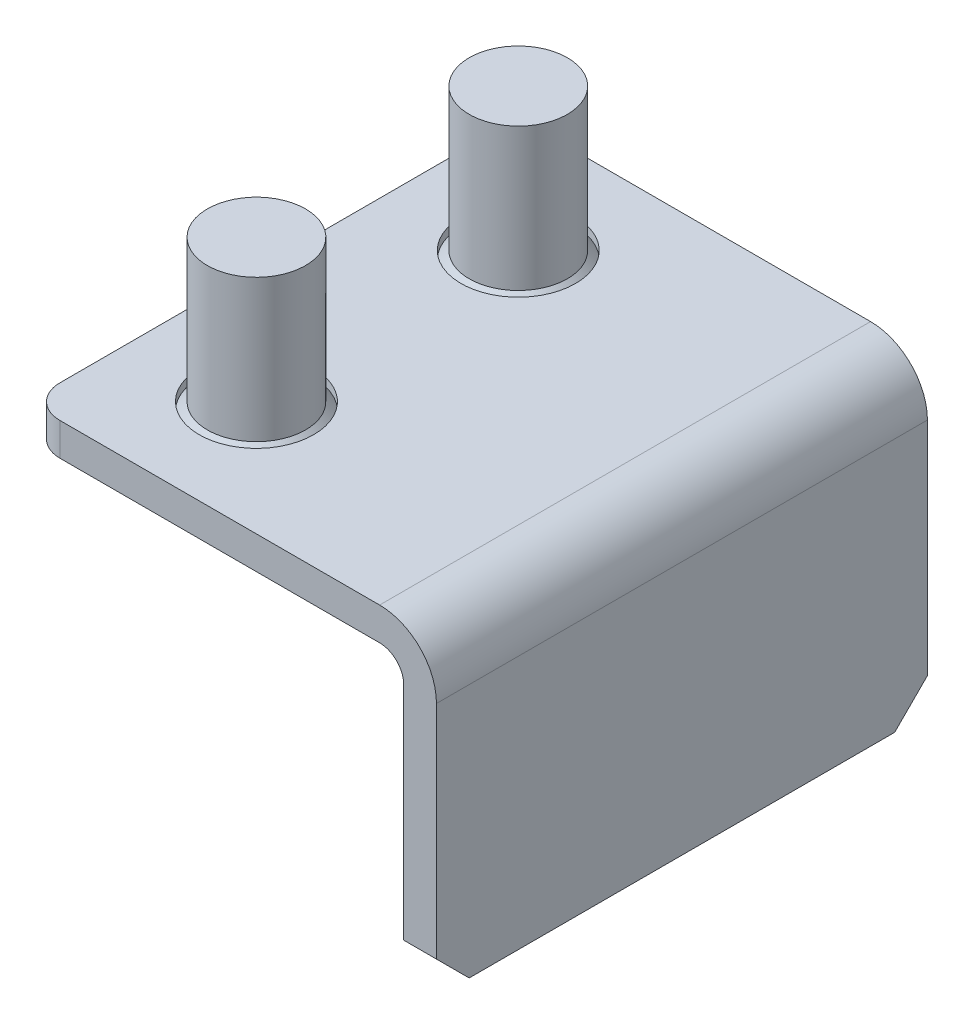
ISO-10303-21;
HEADER;
FILE_DESCRIPTION(('STEP AP214'),'2;1');
FILE_NAME('part.step','',(''),(''),'','','');
FILE_SCHEMA(('AUTOMOTIVE_DESIGN { 1 0 10303 214 1 1 1 1 }'));
ENDSEC;
DATA;
#1=APPLICATION_CONTEXT('core data for automotive mechanical design processes');
#2=APPLICATION_PROTOCOL_DEFINITION('international standard','automotive_design',2000,#1);
#3=PRODUCT_CONTEXT('',#1,'mechanical');
#4=PRODUCT('Part','Part','',(#3));
#5=PRODUCT_RELATED_PRODUCT_CATEGORY('part','',(#4));
#6=PRODUCT_DEFINITION_FORMATION('','',#4);
#7=PRODUCT_DEFINITION_CONTEXT('part definition',#1,'design');
#8=PRODUCT_DEFINITION('design','',#6,#7);
#9=PRODUCT_DEFINITION_SHAPE('','',#8);
#10=(LENGTH_UNIT() NAMED_UNIT(*) SI_UNIT(.MILLI.,.METRE.));
#11=(NAMED_UNIT(*) PLANE_ANGLE_UNIT() SI_UNIT($,.RADIAN.));
#12=(NAMED_UNIT(*) SI_UNIT($,.STERADIAN.) SOLID_ANGLE_UNIT());
#13=UNCERTAINTY_MEASURE_WITH_UNIT(LENGTH_MEASURE(1.E-05),#10,'distance_accuracy_value','');
#14=(GEOMETRIC_REPRESENTATION_CONTEXT(3) GLOBAL_UNCERTAINTY_ASSIGNED_CONTEXT((#13)) GLOBAL_UNIT_ASSIGNED_CONTEXT((#10,
#11,#12)) REPRESENTATION_CONTEXT('',''));
#15=CARTESIAN_POINT('',(0.,0.,0.));
#16=DIRECTION('',(0.,0.,1.));
#17=DIRECTION('',(1.,0.,0.));
#18=AXIS2_PLACEMENT_3D('',#15,#16,#17);
#19=CARTESIAN_POINT('',(36.9999999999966,25.8658129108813,99.7000000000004));
#20=DIRECTION('',(0.,1.,0.));
#21=DIRECTION('',(0.,0.,-1.));
#22=AXIS2_PLACEMENT_3D('',#19,#20,#21);
#23=CYLINDRICAL_SURFACE('',#22,1.5);
#24=CARTESIAN_POINT('',(36.9999999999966,27.35,99.7000000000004));
#25=DIRECTION('',(0.,1.,0.));
#26=DIRECTION('',(0.,0.,-1.));
#27=AXIS2_PLACEMENT_3D('',#24,#25,#26);
#28=CIRCLE('',#27,1.5);
#29=CARTESIAN_POINT('',(36.9999999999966,27.35,98.2000000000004));
#30=VERTEX_POINT('',#29);
#31=EDGE_CURVE('P0_E324',#30,#30,#28,.T.);
#32=ORIENTED_EDGE('',*,*,#31,.F.);
#33=EDGE_LOOP('',(#32));
#34=FACE_BOUND('',#33,.T.);
#35=CARTESIAN_POINT('',(36.9999999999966,23.,99.7000000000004));
#36=DIRECTION('',(0.,1.,0.));
#37=DIRECTION('',(0.,0.,-1.));
#38=AXIS2_PLACEMENT_3D('',#35,#36,#37);
#39=CIRCLE('',#38,1.5);
#40=CARTESIAN_POINT('',(36.9999999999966,23.,98.2000000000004));
#41=VERTEX_POINT('',#40);
#42=EDGE_CURVE('P0_E11',#41,#41,#39,.T.);
#43=ORIENTED_EDGE('',*,*,#42,.T.);
#44=EDGE_LOOP('',(#43));
#45=FACE_BOUND('',#44,.T.);
#46=ADVANCED_FACE('P0_F16',(#34,#45),#23,.T.);
#47=CARTESIAN_POINT('',(36.9999999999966,23.,99.7000000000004));
#48=DIRECTION('',(0.,-1.,0.));
#49=DIRECTION('',(0.,0.,1.));
#50=AXIS2_PLACEMENT_3D('',#47,#48,#49);
#51=CONICAL_SURFACE('',#50,1.5,0.78539816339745);
#52=CARTESIAN_POINT('',(36.9999999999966,21.9,99.7000000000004));
#53=DIRECTION('',(0.,1.,0.));
#54=DIRECTION('',(0.,0.,-1.));
#55=AXIS2_PLACEMENT_3D('',#52,#53,#54);
#56=CIRCLE('',#55,2.6);
#57=CARTESIAN_POINT('',(36.9999999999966,21.9,97.1000000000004));
#58=VERTEX_POINT('',#57);
#59=EDGE_CURVE('P0_E27',#58,#58,#56,.T.);
#60=ORIENTED_EDGE('',*,*,#59,.T.);
#61=EDGE_LOOP('',(#60));
#62=FACE_BOUND('',#61,.T.);
#63=ORIENTED_EDGE('',*,*,#42,.F.);
#64=EDGE_LOOP('',(#63));
#65=FACE_BOUND('',#64,.T.);
#66=ADVANCED_FACE('P0_F383',(#62,#65),#51,.T.);
#67=CARTESIAN_POINT('',(36.9999999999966,25.8658129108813,99.7000000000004));
#68=DIRECTION('',(0.,1.,0.));
#69=DIRECTION('',(0.,0.,-1.));
#70=AXIS2_PLACEMENT_3D('',#67,#68,#69);
#71=CYLINDRICAL_SURFACE('',#70,2.6);
#72=ORIENTED_EDGE('',*,*,#59,.F.);
#73=EDGE_LOOP('',(#72));
#74=FACE_BOUND('',#73,.T.);
#75=CARTESIAN_POINT('',(36.9999999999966,21.35,99.7000000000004));
#76=DIRECTION('',(0.,1.,0.));
#77=DIRECTION('',(0.,0.,-1.));
#78=AXIS2_PLACEMENT_3D('',#75,#76,#77);
#79=CIRCLE('',#78,2.6);
#80=CARTESIAN_POINT('',(36.9999999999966,21.35,97.1000000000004));
#81=VERTEX_POINT('',#80);
#82=EDGE_CURVE('P0_E367',#81,#81,#79,.T.);
#83=ORIENTED_EDGE('',*,*,#82,.T.);
#84=EDGE_LOOP('',(#83));
#85=FACE_BOUND('',#84,.T.);
#86=ADVANCED_FACE('P0_F388',(#74,#85),#71,.T.);
#87=CARTESIAN_POINT('',(34.3999999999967,21.35,99.7000000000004));
#88=DIRECTION('',(0.,-1.,0.));
#89=DIRECTION('',(0.,0.,1.));
#90=AXIS2_PLACEMENT_3D('',#87,#88,#89);
#91=PLANE('',#90);
#92=ORIENTED_EDGE('',*,*,#82,.F.);
#93=EDGE_LOOP('',(#92));
#94=FACE_BOUND('',#93,.T.);
#95=DIRECTION('',(-1.,0.,0.));
#96=VECTOR('',#95,1.);
#97=CARTESIAN_POINT('',(37.3199999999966,21.35,99.3800000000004));
#98=LINE('',#97,#96);
#99=CARTESIAN_POINT('',(38.5999999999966,21.35,99.3800000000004));
#100=VERTEX_POINT('',#99);
#101=CARTESIAN_POINT('',(37.6199999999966,21.35,99.3800000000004));
#102=VERTEX_POINT('',#101);
#103=EDGE_CURVE('P0_E354',#100,#102,#98,.T.);
#104=ORIENTED_EDGE('',*,*,#103,.T.);
#105=CARTESIAN_POINT('',(37.6199999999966,21.35,99.0800000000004));
#106=DIRECTION('',(0.,-1.,0.));
#107=DIRECTION('',(0.,0.,1.));
#108=AXIS2_PLACEMENT_3D('',#105,#106,#107);
#109=CIRCLE('',#108,0.299999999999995);
#110=CARTESIAN_POINT('',(37.3199999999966,21.35,99.0800000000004));
#111=VERTEX_POINT('',#110);
#112=EDGE_CURVE('P0_E36',#102,#111,#109,.T.);
#113=ORIENTED_EDGE('',*,*,#112,.T.);
#114=DIRECTION('',(0.,0.,-1.));
#115=VECTOR('',#114,1.);
#116=CARTESIAN_POINT('',(37.3199999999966,21.35,99.3800000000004));
#117=LINE('',#116,#115);
#118=CARTESIAN_POINT('',(37.3199999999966,21.35,98.1000000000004));
#119=VERTEX_POINT('',#118);
#120=EDGE_CURVE('P0_E296',#111,#119,#117,.T.);
#121=ORIENTED_EDGE('',*,*,#120,.T.);
#122=DIRECTION('',(-1.,0.,0.));
#123=VECTOR('',#122,1.);
#124=CARTESIAN_POINT('',(36.6799999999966,21.35,98.1000000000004));
#125=LINE('',#124,#123);
#126=CARTESIAN_POINT('',(36.6799999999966,21.35,98.1000000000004));
#127=VERTEX_POINT('',#126);
#128=EDGE_CURVE('P0_E292',#119,#127,#125,.T.);
#129=ORIENTED_EDGE('',*,*,#128,.T.);
#130=DIRECTION('',(0.,0.,1.));
#131=VECTOR('',#130,1.);
#132=CARTESIAN_POINT('',(36.6799999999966,21.35,99.3800000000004));
#133=LINE('',#132,#131);
#134=CARTESIAN_POINT('',(36.6799999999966,21.35,99.0800000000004));
#135=VERTEX_POINT('',#134);
#136=EDGE_CURVE('P0_E357',#127,#135,#133,.T.);
#137=ORIENTED_EDGE('',*,*,#136,.T.);
#138=CARTESIAN_POINT('',(36.3799999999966,21.35,99.0800000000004));
#139=DIRECTION('',(0.,-1.,0.));
#140=DIRECTION('',(0.,0.,1.));
#141=AXIS2_PLACEMENT_3D('',#138,#139,#140);
#142=CIRCLE('',#141,0.299999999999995);
#143=CARTESIAN_POINT('',(36.3799999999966,21.35,99.3800000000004));
#144=VERTEX_POINT('',#143);
#145=EDGE_CURVE('P0_E284',#135,#144,#142,.T.);
#146=ORIENTED_EDGE('',*,*,#145,.T.);
#147=DIRECTION('',(-1.,0.,0.));
#148=VECTOR('',#147,1.);
#149=CARTESIAN_POINT('',(36.6799999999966,21.35,99.3800000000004));
#150=LINE('',#149,#148);
#151=CARTESIAN_POINT('',(35.3999999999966,21.35,99.3800000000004));
#152=VERTEX_POINT('',#151);
#153=EDGE_CURVE('P0_E280',#144,#152,#150,.T.);
#154=ORIENTED_EDGE('',*,*,#153,.T.);
#155=DIRECTION('',(0.,0.,1.));
#156=VECTOR('',#155,1.);
#157=CARTESIAN_POINT('',(35.3999999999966,21.35,99.3800000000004));
#158=LINE('',#157,#156);
#159=CARTESIAN_POINT('',(35.3999999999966,21.35,100.02));
#160=VERTEX_POINT('',#159);
#161=EDGE_CURVE('P0_E273',#152,#160,#158,.T.);
#162=ORIENTED_EDGE('',*,*,#161,.T.);
#163=DIRECTION('',(1.,0.,0.));
#164=VECTOR('',#163,1.);
#165=CARTESIAN_POINT('',(36.6799999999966,21.35,100.02));
#166=LINE('',#165,#164);
#167=CARTESIAN_POINT('',(36.3799999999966,21.35,100.02));
#168=VERTEX_POINT('',#167);
#169=EDGE_CURVE('P0_E342',#160,#168,#166,.T.);
#170=ORIENTED_EDGE('',*,*,#169,.T.);
#171=CARTESIAN_POINT('',(36.3799999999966,21.35,100.32));
#172=DIRECTION('',(0.,-1.,0.));
#173=DIRECTION('',(0.,0.,1.));
#174=AXIS2_PLACEMENT_3D('',#171,#172,#173);
#175=CIRCLE('',#174,0.299999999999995);
#176=CARTESIAN_POINT('',(36.6799999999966,21.35,100.32));
#177=VERTEX_POINT('',#176);
#178=EDGE_CURVE('P0_E139',#168,#177,#175,.T.);
#179=ORIENTED_EDGE('',*,*,#178,.T.);
#180=DIRECTION('',(0.,0.,1.));
#181=VECTOR('',#180,1.);
#182=CARTESIAN_POINT('',(36.6799999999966,21.35,100.02));
#183=LINE('',#182,#181);
#184=CARTESIAN_POINT('',(36.6799999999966,21.35,101.3));
#185=VERTEX_POINT('',#184);
#186=EDGE_CURVE('P0_E339',#177,#185,#183,.T.);
#187=ORIENTED_EDGE('',*,*,#186,.T.);
#188=DIRECTION('',(1.,0.,0.));
#189=VECTOR('',#188,1.);
#190=CARTESIAN_POINT('',(36.6799999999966,21.35,101.3));
#191=LINE('',#190,#189);
#192=CARTESIAN_POINT('',(37.3199999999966,21.35,101.3));
#193=VERTEX_POINT('',#192);
#194=EDGE_CURVE('P0_E318',#185,#193,#191,.T.);
#195=ORIENTED_EDGE('',*,*,#194,.T.);
#196=DIRECTION('',(0.,0.,-1.));
#197=VECTOR('',#196,1.);
#198=CARTESIAN_POINT('',(37.3199999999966,21.35,100.02));
#199=LINE('',#198,#197);
#200=CARTESIAN_POINT('',(37.3199999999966,21.35,100.32));
#201=VERTEX_POINT('',#200);
#202=EDGE_CURVE('P0_E314',#193,#201,#199,.T.);
#203=ORIENTED_EDGE('',*,*,#202,.T.);
#204=CARTESIAN_POINT('',(37.6199999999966,21.35,100.32));
#205=DIRECTION('',(0.,-1.,0.));
#206=DIRECTION('',(0.,0.,1.));
#207=AXIS2_PLACEMENT_3D('',#204,#205,#206);
#208=CIRCLE('',#207,0.299999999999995);
#209=CARTESIAN_POINT('',(37.6199999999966,21.35,100.02));
#210=VERTEX_POINT('',#209);
#211=EDGE_CURVE('P0_E188',#201,#210,#208,.T.);
#212=ORIENTED_EDGE('',*,*,#211,.T.);
#213=DIRECTION('',(1.,0.,0.));
#214=VECTOR('',#213,1.);
#215=CARTESIAN_POINT('',(37.3199999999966,21.35,100.02));
#216=LINE('',#215,#214);
#217=CARTESIAN_POINT('',(38.5999999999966,21.35,100.02));
#218=VERTEX_POINT('',#217);
#219=EDGE_CURVE('P0_E308',#210,#218,#216,.T.);
#220=ORIENTED_EDGE('',*,*,#219,.T.);
#221=DIRECTION('',(0.,0.,-1.));
#222=VECTOR('',#221,1.);
#223=CARTESIAN_POINT('',(38.5999999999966,21.35,99.3800000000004));
#224=LINE('',#223,#222);
#225=EDGE_CURVE('P0_E304',#218,#100,#224,.T.);
#226=ORIENTED_EDGE('',*,*,#225,.T.);
#227=EDGE_LOOP('',(#104,#113,#121,#129,#137,#146,#154,#162,#170,#179,#187,#195,#203,#212,#220,#226));
#228=FACE_BOUND('',#227,.T.);
#229=ADVANCED_FACE('P0_F312',(#94,#228),#91,.T.);
#230=CARTESIAN_POINT('',(35.4999999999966,27.35,99.7000000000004));
#231=DIRECTION('',(0.,1.,0.));
#232=DIRECTION('',(0.,0.,-1.));
#233=AXIS2_PLACEMENT_3D('',#230,#231,#232);
#234=PLANE('',#233);
#235=ORIENTED_EDGE('',*,*,#31,.T.);
#236=EDGE_LOOP('',(#235));
#237=FACE_BOUND('',#236,.T.);
#238=ADVANCED_FACE('P0_F379',(#237),#234,.T.);
#239=CARTESIAN_POINT('',(36.6799999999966,22.175,100.02));
#240=DIRECTION('',(1.,0.,0.));
#241=DIRECTION('',(0.,0.,-1.));
#242=AXIS2_PLACEMENT_3D('',#239,#240,#241);
#243=PLANE('',#242);
#244=ORIENTED_EDGE('',*,*,#186,.F.);
#245=DIRECTION('',(0.,1.,0.));
#246=VECTOR('',#245,1.);
#247=CARTESIAN_POINT('',(36.6799999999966,22.175,100.32));
#248=LINE('',#247,#246);
#249=CARTESIAN_POINT('',(36.6799999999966,22.175,100.32));
#250=VERTEX_POINT('',#249);
#251=EDGE_CURVE('P0_E325',#177,#250,#248,.T.);
#252=ORIENTED_EDGE('',*,*,#251,.T.);
#253=DIRECTION('',(0.,0.,1.));
#254=VECTOR('',#253,1.);
#255=CARTESIAN_POINT('',(36.6799999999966,22.175,100.02));
#256=LINE('',#255,#254);
#257=CARTESIAN_POINT('',(36.6799999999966,22.175,100.823686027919));
#258=VERTEX_POINT('',#257);
#259=EDGE_CURVE('P0_E153',#250,#258,#256,.T.);
#260=ORIENTED_EDGE('',*,*,#259,.T.);
#261=DIRECTION('',(0.,-0.866025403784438,0.500000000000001));
#262=VECTOR('',#261,1.);
#263=CARTESIAN_POINT('',(36.6799999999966,21.35,101.3));
#264=LINE('',#263,#262);
#265=EDGE_CURVE('P0_E330',#258,#185,#264,.T.);
#266=ORIENTED_EDGE('',*,*,#265,.T.);
#267=EDGE_LOOP('',(#244,#252,#260,#266));
#268=FACE_BOUND('',#267,.T.);
#269=ADVANCED_FACE('P0_F338',(#268),#243,.T.);
#270=CARTESIAN_POINT('',(36.6799999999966,21.35,101.3));
#271=DIRECTION('',(0.,-0.500000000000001,-0.866025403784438));
#272=DIRECTION('',(0.,-0.866025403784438,0.500000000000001));
#273=AXIS2_PLACEMENT_3D('',#270,#271,#272);
#274=PLANE('',#273);
#275=ORIENTED_EDGE('',*,*,#194,.F.);
#276=ORIENTED_EDGE('',*,*,#265,.F.);
#277=DIRECTION('',(1.,0.,0.));
#278=VECTOR('',#277,1.);
#279=CARTESIAN_POINT('',(36.6799999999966,22.175,100.823686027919));
#280=LINE('',#279,#278);
#281=CARTESIAN_POINT('',(37.3199999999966,22.175,100.823686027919));
#282=VERTEX_POINT('',#281);
#283=EDGE_CURVE('P0_E200',#258,#282,#280,.T.);
#284=ORIENTED_EDGE('',*,*,#283,.T.);
#285=DIRECTION('',(0.,-0.866025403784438,0.500000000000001));
#286=VECTOR('',#285,1.);
#287=CARTESIAN_POINT('',(37.3199999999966,22.5230062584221,100.622764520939));
#288=LINE('',#287,#286);
#289=EDGE_CURVE('P0_E195',#282,#193,#288,.T.);
#290=ORIENTED_EDGE('',*,*,#289,.T.);
#291=EDGE_LOOP('',(#275,#276,#284,#290));
#292=FACE_BOUND('',#291,.T.);
#293=ADVANCED_FACE('P0_F335',(#292),#274,.T.);
#294=CARTESIAN_POINT('',(37.3199999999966,22.175,100.02));
#295=DIRECTION('',(-1.,0.,0.));
#296=DIRECTION('',(0.,0.,1.));
#297=AXIS2_PLACEMENT_3D('',#294,#295,#296);
#298=PLANE('',#297);
#299=DIRECTION('',(0.,0.,-1.));
#300=VECTOR('',#299,1.);
#301=CARTESIAN_POINT('',(37.3199999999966,22.175,100.02));
#302=LINE('',#301,#300);
#303=CARTESIAN_POINT('',(37.3199999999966,22.175,100.32));
#304=VERTEX_POINT('',#303);
#305=EDGE_CURVE('P0_E177',#282,#304,#302,.T.);
#306=ORIENTED_EDGE('',*,*,#305,.T.);
#307=DIRECTION('',(0.,-1.,0.));
#308=VECTOR('',#307,1.);
#309=CARTESIAN_POINT('',(37.3199999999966,22.175,100.32));
#310=LINE('',#309,#308);
#311=EDGE_CURVE('P0_E186',#304,#201,#310,.T.);
#312=ORIENTED_EDGE('',*,*,#311,.T.);
#313=ORIENTED_EDGE('',*,*,#202,.F.);
#314=ORIENTED_EDGE('',*,*,#289,.F.);
#315=EDGE_LOOP('',(#306,#312,#313,#314));
#316=FACE_BOUND('',#315,.T.);
#317=ADVANCED_FACE('P0_F193',(#316),#298,.T.);
#318=CARTESIAN_POINT('',(37.3199999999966,22.175,100.02));
#319=DIRECTION('',(0.,0.,-1.));
#320=DIRECTION('',(-1.,0.,0.));
#321=AXIS2_PLACEMENT_3D('',#318,#319,#320);
#322=PLANE('',#321);
#323=ORIENTED_EDGE('',*,*,#219,.F.);
#324=DIRECTION('',(0.,1.,0.));
#325=VECTOR('',#324,1.);
#326=CARTESIAN_POINT('',(37.6199999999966,22.175,100.02));
#327=LINE('',#326,#325);
#328=CARTESIAN_POINT('',(37.6199999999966,22.175,100.02));
#329=VERTEX_POINT('',#328);
#330=EDGE_CURVE('P0_E184',#210,#329,#327,.T.);
#331=ORIENTED_EDGE('',*,*,#330,.T.);
#332=DIRECTION('',(1.,0.,0.));
#333=VECTOR('',#332,1.);
#334=CARTESIAN_POINT('',(37.3199999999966,22.175,100.02));
#335=LINE('',#334,#333);
#336=CARTESIAN_POINT('',(38.1236860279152,22.175,100.02));
#337=VERTEX_POINT('',#336);
#338=EDGE_CURVE('P0_E180',#329,#337,#335,.T.);
#339=ORIENTED_EDGE('',*,*,#338,.T.);
#340=DIRECTION('',(0.500000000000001,-0.866025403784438,0.));
#341=VECTOR('',#340,1.);
#342=CARTESIAN_POINT('',(38.5999999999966,21.35,100.02));
#343=LINE('',#342,#341);
#344=EDGE_CURVE('P0_E208',#337,#218,#343,.T.);
#345=ORIENTED_EDGE('',*,*,#344,.T.);
#346=EDGE_LOOP('',(#323,#331,#339,#345));
#347=FACE_BOUND('',#346,.T.);
#348=ADVANCED_FACE('P0_F307',(#347),#322,.T.);
#349=CARTESIAN_POINT('',(38.5999999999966,21.35,99.3800000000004));
#350=DIRECTION('',(-0.866025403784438,-0.500000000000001,0.));
#351=DIRECTION('',(0.500000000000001,-0.866025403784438,0.));
#352=AXIS2_PLACEMENT_3D('',#349,#350,#351);
#353=PLANE('',#352);
#354=ORIENTED_EDGE('',*,*,#225,.F.);
#355=ORIENTED_EDGE('',*,*,#344,.F.);
#356=DIRECTION('',(0.,0.,-1.));
#357=VECTOR('',#356,1.);
#358=CARTESIAN_POINT('',(38.1236860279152,22.175,99.3800000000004));
#359=LINE('',#358,#357);
#360=CARTESIAN_POINT('',(38.1236860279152,22.175,99.3800000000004));
#361=VERTEX_POINT('',#360);
#362=EDGE_CURVE('P0_E211',#337,#361,#359,.T.);
#363=ORIENTED_EDGE('',*,*,#362,.T.);
#364=DIRECTION('',(0.500000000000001,-0.866025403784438,0.));
#365=VECTOR('',#364,1.);
#366=CARTESIAN_POINT('',(37.9227645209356,22.5230062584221,99.3800000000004));
#367=LINE('',#366,#365);
#368=EDGE_CURVE('P0_E215',#361,#100,#367,.T.);
#369=ORIENTED_EDGE('',*,*,#368,.T.);
#370=EDGE_LOOP('',(#354,#355,#363,#369));
#371=FACE_BOUND('',#370,.T.);
#372=ADVANCED_FACE('P0_F302',(#371),#353,.T.);
#373=CARTESIAN_POINT('',(37.3199999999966,22.175,99.3800000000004));
#374=DIRECTION('',(0.,0.,1.));
#375=DIRECTION('',(0.,1.,0.));
#376=AXIS2_PLACEMENT_3D('',#373,#374,#375);
#377=PLANE('',#376);
#378=DIRECTION('',(-1.,0.,0.));
#379=VECTOR('',#378,1.);
#380=CARTESIAN_POINT('',(37.3199999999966,22.175,99.3800000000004));
#381=LINE('',#380,#379);
#382=CARTESIAN_POINT('',(37.6199999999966,22.175,99.3800000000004));
#383=VERTEX_POINT('',#382);
#384=EDGE_CURVE('P0_E219',#361,#383,#381,.T.);
#385=ORIENTED_EDGE('',*,*,#384,.T.);
#386=DIRECTION('',(0.,-1.,0.));
#387=VECTOR('',#386,1.);
#388=CARTESIAN_POINT('',(37.6199999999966,22.175,99.3800000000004));
#389=LINE('',#388,#387);
#390=EDGE_CURVE('P0_E223',#383,#102,#389,.T.);
#391=ORIENTED_EDGE('',*,*,#390,.T.);
#392=ORIENTED_EDGE('',*,*,#103,.F.);
#393=ORIENTED_EDGE('',*,*,#368,.F.);
#394=EDGE_LOOP('',(#385,#391,#392,#393));
#395=FACE_BOUND('',#394,.T.);
#396=ADVANCED_FACE('P0_F300',(#395),#377,.T.);
#397=CARTESIAN_POINT('',(37.3199999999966,22.175,99.3800000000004));
#398=DIRECTION('',(-1.,0.,0.));
#399=DIRECTION('',(0.,0.,1.));
#400=AXIS2_PLACEMENT_3D('',#397,#398,#399);
#401=PLANE('',#400);
#402=ORIENTED_EDGE('',*,*,#120,.F.);
#403=DIRECTION('',(0.,1.,0.));
#404=VECTOR('',#403,1.);
#405=CARTESIAN_POINT('',(37.3199999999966,22.175,99.0800000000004));
#406=LINE('',#405,#404);
#407=CARTESIAN_POINT('',(37.3199999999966,22.175,99.0800000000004));
#408=VERTEX_POINT('',#407);
#409=EDGE_CURVE('P0_E227',#111,#408,#406,.T.);
#410=ORIENTED_EDGE('',*,*,#409,.T.);
#411=DIRECTION('',(0.,0.,-1.));
#412=VECTOR('',#411,1.);
#413=CARTESIAN_POINT('',(37.3199999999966,22.175,99.3800000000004));
#414=LINE('',#413,#412);
#415=CARTESIAN_POINT('',(37.3199999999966,22.175,98.5763139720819));
#416=VERTEX_POINT('',#415);
#417=EDGE_CURVE('P0_E231',#408,#416,#414,.T.);
#418=ORIENTED_EDGE('',*,*,#417,.T.);
#419=DIRECTION('',(0.,-0.866025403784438,-0.500000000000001));
#420=VECTOR('',#419,1.);
#421=CARTESIAN_POINT('',(37.3199999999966,21.35,98.1000000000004));
#422=LINE('',#421,#420);
#423=EDGE_CURVE('P0_E235',#416,#119,#422,.T.);
#424=ORIENTED_EDGE('',*,*,#423,.T.);
#425=EDGE_LOOP('',(#402,#410,#418,#424));
#426=FACE_BOUND('',#425,.T.);
#427=ADVANCED_FACE('P0_F295',(#426),#401,.T.);
#428=CARTESIAN_POINT('',(36.6799999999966,21.35,98.1000000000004));
#429=DIRECTION('',(0.,-0.500000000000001,0.866025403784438));
#430=DIRECTION('',(0.,0.866025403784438,0.500000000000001));
#431=AXIS2_PLACEMENT_3D('',#428,#429,#430);
#432=PLANE('',#431);
#433=ORIENTED_EDGE('',*,*,#128,.F.);
#434=ORIENTED_EDGE('',*,*,#423,.F.);
#435=DIRECTION('',(-1.,0.,0.));
#436=VECTOR('',#435,1.);
#437=CARTESIAN_POINT('',(36.6799999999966,22.175,98.5763139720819));
#438=LINE('',#437,#436);
#439=CARTESIAN_POINT('',(36.6799999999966,22.175,98.5763139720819));
#440=VERTEX_POINT('',#439);
#441=EDGE_CURVE('P0_E239',#416,#440,#438,.T.);
#442=ORIENTED_EDGE('',*,*,#441,.T.);
#443=DIRECTION('',(0.,-0.866025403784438,-0.500000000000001));
#444=VECTOR('',#443,1.);
#445=CARTESIAN_POINT('',(36.6799999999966,22.5230062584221,98.7772354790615));
#446=LINE('',#445,#444);
#447=EDGE_CURVE('P0_E243',#440,#127,#446,.T.);
#448=ORIENTED_EDGE('',*,*,#447,.T.);
#449=EDGE_LOOP('',(#433,#434,#442,#448));
#450=FACE_BOUND('',#449,.T.);
#451=ADVANCED_FACE('P0_F290',(#450),#432,.T.);
#452=CARTESIAN_POINT('',(36.6799999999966,22.175,99.3800000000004));
#453=DIRECTION('',(1.,0.,0.));
#454=DIRECTION('',(0.,0.,-1.));
#455=AXIS2_PLACEMENT_3D('',#452,#453,#454);
#456=PLANE('',#455);
#457=DIRECTION('',(0.,0.,1.));
#458=VECTOR('',#457,1.);
#459=CARTESIAN_POINT('',(36.6799999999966,22.175,99.3800000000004));
#460=LINE('',#459,#458);
#461=CARTESIAN_POINT('',(36.6799999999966,22.175,99.0800000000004));
#462=VERTEX_POINT('',#461);
#463=EDGE_CURVE('P0_E246',#440,#462,#460,.T.);
#464=ORIENTED_EDGE('',*,*,#463,.T.);
#465=DIRECTION('',(0.,-1.,0.));
#466=VECTOR('',#465,1.);
#467=CARTESIAN_POINT('',(36.6799999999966,22.175,99.0800000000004));
#468=LINE('',#467,#466);
#469=EDGE_CURVE('P0_E250',#462,#135,#468,.T.);
#470=ORIENTED_EDGE('',*,*,#469,.T.);
#471=ORIENTED_EDGE('',*,*,#136,.F.);
#472=ORIENTED_EDGE('',*,*,#447,.F.);
#473=EDGE_LOOP('',(#464,#470,#471,#472));
#474=FACE_BOUND('',#473,.T.);
#475=ADVANCED_FACE('P0_F287',(#474),#456,.T.);
#476=CARTESIAN_POINT('',(36.6799999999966,22.175,99.3800000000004));
#477=DIRECTION('',(0.,0.,1.));
#478=DIRECTION('',(0.,1.,0.));
#479=AXIS2_PLACEMENT_3D('',#476,#477,#478);
#480=PLANE('',#479);
#481=ORIENTED_EDGE('',*,*,#153,.F.);
#482=DIRECTION('',(0.,1.,0.));
#483=VECTOR('',#482,1.);
#484=CARTESIAN_POINT('',(36.3799999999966,22.175,99.3800000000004));
#485=LINE('',#484,#483);
#486=CARTESIAN_POINT('',(36.3799999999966,22.175,99.3800000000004));
#487=VERTEX_POINT('',#486);
#488=EDGE_CURVE('P0_E254',#144,#487,#485,.T.);
#489=ORIENTED_EDGE('',*,*,#488,.T.);
#490=DIRECTION('',(-1.,0.,0.));
#491=VECTOR('',#490,1.);
#492=CARTESIAN_POINT('',(36.6799999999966,22.175,99.3800000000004));
#493=LINE('',#492,#491);
#494=CARTESIAN_POINT('',(35.8763139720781,22.175,99.3800000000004));
#495=VERTEX_POINT('',#494);
#496=EDGE_CURVE('P0_E258',#487,#495,#493,.T.);
#497=ORIENTED_EDGE('',*,*,#496,.T.);
#498=DIRECTION('',(-0.500000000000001,-0.866025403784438,0.));
#499=VECTOR('',#498,1.);
#500=CARTESIAN_POINT('',(35.3999999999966,21.35,99.3800000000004));
#501=LINE('',#500,#499);
#502=EDGE_CURVE('P0_E262',#495,#152,#501,.T.);
#503=ORIENTED_EDGE('',*,*,#502,.T.);
#504=EDGE_LOOP('',(#481,#489,#497,#503));
#505=FACE_BOUND('',#504,.T.);
#506=ADVANCED_FACE('P0_F279',(#505),#480,.T.);
#507=CARTESIAN_POINT('',(35.3999999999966,21.35,99.3800000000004));
#508=DIRECTION('',(0.866025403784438,-0.500000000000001,0.));
#509=DIRECTION('',(0.500000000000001,0.866025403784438,0.));
#510=AXIS2_PLACEMENT_3D('',#507,#508,#509);
#511=PLANE('',#510);
#512=ORIENTED_EDGE('',*,*,#161,.F.);
#513=ORIENTED_EDGE('',*,*,#502,.F.);
#514=DIRECTION('',(0.,0.,1.));
#515=VECTOR('',#514,1.);
#516=CARTESIAN_POINT('',(35.8763139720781,22.175,99.3800000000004));
#517=LINE('',#516,#515);
#518=CARTESIAN_POINT('',(35.8763139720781,22.175,100.02));
#519=VERTEX_POINT('',#518);
#520=EDGE_CURVE('P0_E266',#495,#519,#517,.T.);
#521=ORIENTED_EDGE('',*,*,#520,.T.);
#522=DIRECTION('',(-0.500000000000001,-0.866025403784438,0.));
#523=VECTOR('',#522,1.);
#524=CARTESIAN_POINT('',(36.0772354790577,22.5230062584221,100.02));
#525=LINE('',#524,#523);
#526=EDGE_CURVE('P0_E127',#519,#160,#525,.T.);
#527=ORIENTED_EDGE('',*,*,#526,.T.);
#528=EDGE_LOOP('',(#512,#513,#521,#527));
#529=FACE_BOUND('',#528,.T.);
#530=ADVANCED_FACE('P0_F271',(#529),#511,.T.);
#531=CARTESIAN_POINT('',(36.6799999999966,22.175,100.02));
#532=DIRECTION('',(0.,0.,-1.));
#533=DIRECTION('',(-1.,0.,0.));
#534=AXIS2_PLACEMENT_3D('',#531,#532,#533);
#535=PLANE('',#534);
#536=DIRECTION('',(1.,0.,0.));
#537=VECTOR('',#536,1.);
#538=CARTESIAN_POINT('',(36.6799999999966,22.175,100.02));
#539=LINE('',#538,#537);
#540=CARTESIAN_POINT('',(36.3799999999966,22.175,100.02));
#541=VERTEX_POINT('',#540);
#542=EDGE_CURVE('P0_E142',#519,#541,#539,.T.);
#543=ORIENTED_EDGE('',*,*,#542,.T.);
#544=DIRECTION('',(0.,-1.,0.));
#545=VECTOR('',#544,1.);
#546=CARTESIAN_POINT('',(36.3799999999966,22.175,100.02));
#547=LINE('',#546,#545);
#548=EDGE_CURVE('P0_E133',#541,#168,#547,.T.);
#549=ORIENTED_EDGE('',*,*,#548,.T.);
#550=ORIENTED_EDGE('',*,*,#169,.F.);
#551=ORIENTED_EDGE('',*,*,#526,.F.);
#552=EDGE_LOOP('',(#543,#549,#550,#551));
#553=FACE_BOUND('',#552,.T.);
#554=ADVANCED_FACE('P0_F145',(#553),#535,.T.);
#555=CARTESIAN_POINT('',(36.6799999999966,22.175,100.02));
#556=DIRECTION('',(0.,1.,0.));
#557=DIRECTION('',(0.,0.,-1.));
#558=AXIS2_PLACEMENT_3D('',#555,#556,#557);
#559=PLANE('',#558);
#560=ORIENTED_EDGE('',*,*,#259,.F.);
#561=CARTESIAN_POINT('',(36.3799999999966,22.175,100.32));
#562=DIRECTION('',(0.,1.,0.));
#563=DIRECTION('',(0.,0.,-1.));
#564=AXIS2_PLACEMENT_3D('',#561,#562,#563);
#565=CIRCLE('',#564,0.299999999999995);
#566=EDGE_CURVE('P0_E137',#250,#541,#565,.T.);
#567=ORIENTED_EDGE('',*,*,#566,.T.);
#568=ORIENTED_EDGE('',*,*,#542,.F.);
#569=ORIENTED_EDGE('',*,*,#520,.F.);
#570=ORIENTED_EDGE('',*,*,#496,.F.);
#571=CARTESIAN_POINT('',(36.3799999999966,22.175,99.0800000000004));
#572=DIRECTION('',(0.,1.,0.));
#573=DIRECTION('',(0.,0.,-1.));
#574=AXIS2_PLACEMENT_3D('',#571,#572,#573);
#575=CIRCLE('',#574,0.299999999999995);
#576=EDGE_CURVE('P0_E156',#487,#462,#575,.T.);
#577=ORIENTED_EDGE('',*,*,#576,.T.);
#578=ORIENTED_EDGE('',*,*,#463,.F.);
#579=ORIENTED_EDGE('',*,*,#441,.F.);
#580=ORIENTED_EDGE('',*,*,#417,.F.);
#581=CARTESIAN_POINT('',(37.6199999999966,22.175,99.0800000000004));
#582=DIRECTION('',(0.,1.,0.));
#583=DIRECTION('',(0.,0.,-1.));
#584=AXIS2_PLACEMENT_3D('',#581,#582,#583);
#585=CIRCLE('',#584,0.299999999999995);
#586=EDGE_CURVE('P0_E163',#408,#383,#585,.T.);
#587=ORIENTED_EDGE('',*,*,#586,.T.);
#588=ORIENTED_EDGE('',*,*,#384,.F.);
#589=ORIENTED_EDGE('',*,*,#362,.F.);
#590=ORIENTED_EDGE('',*,*,#338,.F.);
#591=CARTESIAN_POINT('',(37.6199999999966,22.175,100.32));
#592=DIRECTION('',(0.,1.,0.));
#593=DIRECTION('',(0.,0.,-1.));
#594=AXIS2_PLACEMENT_3D('',#591,#592,#593);
#595=CIRCLE('',#594,0.299999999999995);
#596=EDGE_CURVE('P0_E20',#329,#304,#595,.T.);
#597=ORIENTED_EDGE('',*,*,#596,.T.);
#598=ORIENTED_EDGE('',*,*,#305,.F.);
#599=ORIENTED_EDGE('',*,*,#283,.F.);
#600=EDGE_LOOP('',(#560,#567,#568,#569,#570,#577,#578,#579,#580,#587,#588,#589,#590,#597,#598,#599));
#601=FACE_BOUND('',#600,.T.);
#602=ADVANCED_FACE('P0_F150',(#601),#559,.F.);
#603=CARTESIAN_POINT('',(37.6199999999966,22.175,99.0800000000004));
#604=DIRECTION('',(0.,-1.,0.));
#605=DIRECTION('',(0.,0.,1.));
#606=AXIS2_PLACEMENT_3D('',#603,#604,#605);
#607=CYLINDRICAL_SURFACE('',#606,0.299999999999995);
#608=ORIENTED_EDGE('',*,*,#586,.F.);
#609=ORIENTED_EDGE('',*,*,#409,.F.);
#610=ORIENTED_EDGE('',*,*,#112,.F.);
#611=ORIENTED_EDGE('',*,*,#390,.F.);
#612=EDGE_LOOP('',(#608,#609,#610,#611));
#613=FACE_BOUND('',#612,.T.);
#614=ADVANCED_FACE('P0_F297',(#613),#607,.T.);
#615=CARTESIAN_POINT('',(36.3799999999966,22.175,99.0800000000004));
#616=DIRECTION('',(0.,-1.,0.));
#617=DIRECTION('',(0.,0.,1.));
#618=AXIS2_PLACEMENT_3D('',#615,#616,#617);
#619=CYLINDRICAL_SURFACE('',#618,0.299999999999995);
#620=ORIENTED_EDGE('',*,*,#576,.F.);
#621=ORIENTED_EDGE('',*,*,#488,.F.);
#622=ORIENTED_EDGE('',*,*,#145,.F.);
#623=ORIENTED_EDGE('',*,*,#469,.F.);
#624=EDGE_LOOP('',(#620,#621,#622,#623));
#625=FACE_BOUND('',#624,.T.);
#626=ADVANCED_FACE('P0_F283',(#625),#619,.T.);
#627=CARTESIAN_POINT('',(36.3799999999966,22.175,100.32));
#628=DIRECTION('',(0.,-1.,0.));
#629=DIRECTION('',(0.,0.,1.));
#630=AXIS2_PLACEMENT_3D('',#627,#628,#629);
#631=CYLINDRICAL_SURFACE('',#630,0.299999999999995);
#632=ORIENTED_EDGE('',*,*,#566,.F.);
#633=ORIENTED_EDGE('',*,*,#251,.F.);
#634=ORIENTED_EDGE('',*,*,#178,.F.);
#635=ORIENTED_EDGE('',*,*,#548,.F.);
#636=EDGE_LOOP('',(#632,#633,#634,#635));
#637=FACE_BOUND('',#636,.T.);
#638=ADVANCED_FACE('P0_F134',(#637),#631,.T.);
#639=CARTESIAN_POINT('',(37.6199999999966,22.175,100.32));
#640=DIRECTION('',(0.,-1.,0.));
#641=DIRECTION('',(0.,0.,1.));
#642=AXIS2_PLACEMENT_3D('',#639,#640,#641);
#643=CYLINDRICAL_SURFACE('',#642,0.299999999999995);
#644=ORIENTED_EDGE('',*,*,#596,.F.);
#645=ORIENTED_EDGE('',*,*,#330,.F.);
#646=ORIENTED_EDGE('',*,*,#211,.F.);
#647=ORIENTED_EDGE('',*,*,#311,.F.);
#648=EDGE_LOOP('',(#644,#645,#646,#647));
#649=FACE_BOUND('',#648,.T.);
#650=ADVANCED_FACE('P0_F18',(#649),#643,.T.);
#651=CLOSED_SHELL('',(#46,#66,#86,#229,#238,#269,#293,#317,#348,#372,#396,#427,#451,#475,#506,
#530,#554,#602,#614,#626,#638,#650));
#652=MANIFOLD_SOLID_BREP('P0_B1',#651);
#653=CARTESIAN_POINT('',(36.9999999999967,25.8658129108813,107.7));
#654=DIRECTION('',(0.,1.,0.));
#655=DIRECTION('',(0.,0.,-1.));
#656=AXIS2_PLACEMENT_3D('',#653,#654,#655);
#657=CYLINDRICAL_SURFACE('',#656,1.5);
#658=CARTESIAN_POINT('',(36.9999999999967,27.35,107.7));
#659=DIRECTION('',(0.,1.,0.));
#660=DIRECTION('',(0.,0.,-1.));
#661=AXIS2_PLACEMENT_3D('',#658,#659,#660);
#662=CIRCLE('',#661,1.5);
#663=CARTESIAN_POINT('',(36.9999999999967,27.35,106.2));
#664=VERTEX_POINT('',#663);
#665=EDGE_CURVE('P1_E325',#664,#664,#662,.T.);
#666=ORIENTED_EDGE('',*,*,#665,.F.);
#667=EDGE_LOOP('',(#666));
#668=FACE_BOUND('',#667,.T.);
#669=CARTESIAN_POINT('',(36.9999999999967,23.,107.7));
#670=DIRECTION('',(0.,1.,0.));
#671=DIRECTION('',(0.,0.,-1.));
#672=AXIS2_PLACEMENT_3D('',#669,#670,#671);
#673=CIRCLE('',#672,1.5);
#674=CARTESIAN_POINT('',(36.9999999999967,23.,106.2));
#675=VERTEX_POINT('',#674);
#676=EDGE_CURVE('P1_E11',#675,#675,#673,.T.);
#677=ORIENTED_EDGE('',*,*,#676,.T.);
#678=EDGE_LOOP('',(#677));
#679=FACE_BOUND('',#678,.T.);
#680=ADVANCED_FACE('P1_F16',(#668,#679),#657,.T.);
#681=CARTESIAN_POINT('',(36.9999999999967,23.,107.7));
#682=DIRECTION('',(0.,-1.,0.));
#683=DIRECTION('',(0.,0.,1.));
#684=AXIS2_PLACEMENT_3D('',#681,#682,#683);
#685=CONICAL_SURFACE('',#684,1.5,0.78539816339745);
#686=CARTESIAN_POINT('',(36.9999999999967,21.9,107.7));
#687=DIRECTION('',(0.,1.,0.));
#688=DIRECTION('',(0.,0.,-1.));
#689=AXIS2_PLACEMENT_3D('',#686,#687,#688);
#690=CIRCLE('',#689,2.6);
#691=CARTESIAN_POINT('',(36.9999999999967,21.9,105.1));
#692=VERTEX_POINT('',#691);
#693=EDGE_CURVE('P1_E27',#692,#692,#690,.T.);
#694=ORIENTED_EDGE('',*,*,#693,.T.);
#695=EDGE_LOOP('',(#694));
#696=FACE_BOUND('',#695,.T.);
#697=ORIENTED_EDGE('',*,*,#676,.F.);
#698=EDGE_LOOP('',(#697));
#699=FACE_BOUND('',#698,.T.);
#700=ADVANCED_FACE('P1_F383',(#696,#699),#685,.T.);
#701=CARTESIAN_POINT('',(36.9999999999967,25.8658129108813,107.7));
#702=DIRECTION('',(0.,1.,0.));
#703=DIRECTION('',(0.,0.,-1.));
#704=AXIS2_PLACEMENT_3D('',#701,#702,#703);
#705=CYLINDRICAL_SURFACE('',#704,2.6);
#706=ORIENTED_EDGE('',*,*,#693,.F.);
#707=EDGE_LOOP('',(#706));
#708=FACE_BOUND('',#707,.T.);
#709=CARTESIAN_POINT('',(36.9999999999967,21.35,107.7));
#710=DIRECTION('',(0.,1.,0.));
#711=DIRECTION('',(0.,0.,-1.));
#712=AXIS2_PLACEMENT_3D('',#709,#710,#711);
#713=CIRCLE('',#712,2.6);
#714=CARTESIAN_POINT('',(36.9999999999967,21.35,105.1));
#715=VERTEX_POINT('',#714);
#716=EDGE_CURVE('P1_E355',#715,#715,#713,.T.);
#717=ORIENTED_EDGE('',*,*,#716,.T.);
#718=EDGE_LOOP('',(#717));
#719=FACE_BOUND('',#718,.T.);
#720=ADVANCED_FACE('P1_F388',(#708,#719),#705,.T.);
#721=CARTESIAN_POINT('',(34.3999999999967,21.35,107.7));
#722=DIRECTION('',(0.,-1.,0.));
#723=DIRECTION('',(0.,0.,1.));
#724=AXIS2_PLACEMENT_3D('',#721,#722,#723);
#725=PLANE('',#724);
#726=ORIENTED_EDGE('',*,*,#716,.F.);
#727=EDGE_LOOP('',(#726));
#728=FACE_BOUND('',#727,.T.);
#729=DIRECTION('',(-1.,0.,0.));
#730=VECTOR('',#729,1.);
#731=CARTESIAN_POINT('',(37.3199999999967,21.35,107.38));
#732=LINE('',#731,#730);
#733=CARTESIAN_POINT('',(38.5999999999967,21.35,107.38));
#734=VERTEX_POINT('',#733);
#735=CARTESIAN_POINT('',(37.6199999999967,21.35,107.38));
#736=VERTEX_POINT('',#735);
#737=EDGE_CURVE('P1_E361',#734,#736,#732,.T.);
#738=ORIENTED_EDGE('',*,*,#737,.T.);
#739=CARTESIAN_POINT('',(37.6199999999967,21.35,107.08));
#740=DIRECTION('',(0.,-1.,0.));
#741=DIRECTION('',(0.,0.,1.));
#742=AXIS2_PLACEMENT_3D('',#739,#740,#741);
#743=CIRCLE('',#742,0.299999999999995);
#744=CARTESIAN_POINT('',(37.3199999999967,21.35,107.08));
#745=VERTEX_POINT('',#744);
#746=EDGE_CURVE('P1_E36',#736,#745,#743,.T.);
#747=ORIENTED_EDGE('',*,*,#746,.T.);
#748=DIRECTION('',(0.,0.,-1.));
#749=VECTOR('',#748,1.);
#750=CARTESIAN_POINT('',(37.3199999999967,21.35,107.38));
#751=LINE('',#750,#749);
#752=CARTESIAN_POINT('',(37.3199999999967,21.35,106.1));
#753=VERTEX_POINT('',#752);
#754=EDGE_CURVE('P1_E298',#745,#753,#751,.T.);
#755=ORIENTED_EDGE('',*,*,#754,.T.);
#756=DIRECTION('',(-1.,0.,0.));
#757=VECTOR('',#756,1.);
#758=CARTESIAN_POINT('',(36.6799999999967,21.35,106.1));
#759=LINE('',#758,#757);
#760=CARTESIAN_POINT('',(36.6799999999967,21.35,106.1));
#761=VERTEX_POINT('',#760);
#762=EDGE_CURVE('P1_E294',#753,#761,#759,.T.);
#763=ORIENTED_EDGE('',*,*,#762,.T.);
#764=DIRECTION('',(0.,0.,1.));
#765=VECTOR('',#764,1.);
#766=CARTESIAN_POINT('',(36.6799999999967,21.35,107.38));
#767=LINE('',#766,#765);
#768=CARTESIAN_POINT('',(36.6799999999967,21.35,107.08));
#769=VERTEX_POINT('',#768);
#770=EDGE_CURVE('P1_E372',#761,#769,#767,.T.);
#771=ORIENTED_EDGE('',*,*,#770,.T.);
#772=CARTESIAN_POINT('',(36.3799999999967,21.35,107.08));
#773=DIRECTION('',(0.,-1.,0.));
#774=DIRECTION('',(0.,0.,1.));
#775=AXIS2_PLACEMENT_3D('',#772,#773,#774);
#776=CIRCLE('',#775,0.299999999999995);
#777=CARTESIAN_POINT('',(36.3799999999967,21.35,107.38));
#778=VERTEX_POINT('',#777);
#779=EDGE_CURVE('P1_E286',#769,#778,#776,.T.);
#780=ORIENTED_EDGE('',*,*,#779,.T.);
#781=DIRECTION('',(-1.,0.,0.));
#782=VECTOR('',#781,1.);
#783=CARTESIAN_POINT('',(36.6799999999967,21.35,107.38));
#784=LINE('',#783,#782);
#785=CARTESIAN_POINT('',(35.3999999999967,21.35,107.38));
#786=VERTEX_POINT('',#785);
#787=EDGE_CURVE('P1_E282',#778,#786,#784,.T.);
#788=ORIENTED_EDGE('',*,*,#787,.T.);
#789=DIRECTION('',(0.,0.,1.));
#790=VECTOR('',#789,1.);
#791=CARTESIAN_POINT('',(35.3999999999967,21.35,107.38));
#792=LINE('',#791,#790);
#793=CARTESIAN_POINT('',(35.3999999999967,21.35,108.02));
#794=VERTEX_POINT('',#793);
#795=EDGE_CURVE('P1_E275',#786,#794,#792,.T.);
#796=ORIENTED_EDGE('',*,*,#795,.T.);
#797=DIRECTION('',(1.,0.,0.));
#798=VECTOR('',#797,1.);
#799=CARTESIAN_POINT('',(36.6799999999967,21.35,108.02));
#800=LINE('',#799,#798);
#801=CARTESIAN_POINT('',(36.3799999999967,21.35,108.02));
#802=VERTEX_POINT('',#801);
#803=EDGE_CURVE('P1_E345',#794,#802,#800,.T.);
#804=ORIENTED_EDGE('',*,*,#803,.T.);
#805=CARTESIAN_POINT('',(36.3799999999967,21.35,108.32));
#806=DIRECTION('',(0.,-1.,0.));
#807=DIRECTION('',(0.,0.,1.));
#808=AXIS2_PLACEMENT_3D('',#805,#806,#807);
#809=CIRCLE('',#808,0.299999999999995);
#810=CARTESIAN_POINT('',(36.6799999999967,21.35,108.32));
#811=VERTEX_POINT('',#810);
#812=EDGE_CURVE('P1_E139',#802,#811,#809,.T.);
#813=ORIENTED_EDGE('',*,*,#812,.T.);
#814=DIRECTION('',(0.,0.,1.));
#815=VECTOR('',#814,1.);
#816=CARTESIAN_POINT('',(36.6799999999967,21.35,108.02));
#817=LINE('',#816,#815);
#818=CARTESIAN_POINT('',(36.6799999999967,21.35,109.3));
#819=VERTEX_POINT('',#818);
#820=EDGE_CURVE('P1_E342',#811,#819,#817,.T.);
#821=ORIENTED_EDGE('',*,*,#820,.T.);
#822=DIRECTION('',(1.,0.,0.));
#823=VECTOR('',#822,1.);
#824=CARTESIAN_POINT('',(36.6799999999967,21.35,109.3));
#825=LINE('',#824,#823);
#826=CARTESIAN_POINT('',(37.3199999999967,21.35,109.3));
#827=VERTEX_POINT('',#826);
#828=EDGE_CURVE('P1_E319',#819,#827,#825,.T.);
#829=ORIENTED_EDGE('',*,*,#828,.T.);
#830=DIRECTION('',(0.,0.,-1.));
#831=VECTOR('',#830,1.);
#832=CARTESIAN_POINT('',(37.3199999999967,21.35,108.02));
#833=LINE('',#832,#831);
#834=CARTESIAN_POINT('',(37.3199999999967,21.35,108.32));
#835=VERTEX_POINT('',#834);
#836=EDGE_CURVE('P1_E316',#827,#835,#833,.T.);
#837=ORIENTED_EDGE('',*,*,#836,.T.);
#838=CARTESIAN_POINT('',(37.6199999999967,21.35,108.32));
#839=DIRECTION('',(0.,-1.,0.));
#840=DIRECTION('',(0.,0.,1.));
#841=AXIS2_PLACEMENT_3D('',#838,#839,#840);
#842=CIRCLE('',#841,0.299999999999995);
#843=CARTESIAN_POINT('',(37.6199999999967,21.35,108.02));
#844=VERTEX_POINT('',#843);
#845=EDGE_CURVE('P1_E188',#835,#844,#842,.T.);
#846=ORIENTED_EDGE('',*,*,#845,.T.);
#847=DIRECTION('',(1.,0.,0.));
#848=VECTOR('',#847,1.);
#849=CARTESIAN_POINT('',(37.3199999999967,21.35,108.02));
#850=LINE('',#849,#848);
#851=CARTESIAN_POINT('',(38.5999999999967,21.35,108.02));
#852=VERTEX_POINT('',#851);
#853=EDGE_CURVE('P1_E310',#844,#852,#850,.T.);
#854=ORIENTED_EDGE('',*,*,#853,.T.);
#855=DIRECTION('',(0.,0.,-1.));
#856=VECTOR('',#855,1.);
#857=CARTESIAN_POINT('',(38.5999999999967,21.35,107.38));
#858=LINE('',#857,#856);
#859=EDGE_CURVE('P1_E306',#852,#734,#858,.T.);
#860=ORIENTED_EDGE('',*,*,#859,.T.);
#861=EDGE_LOOP('',(#738,#747,#755,#763,#771,#780,#788,#796,#804,#813,#821,#829,#837,#846,#854,#860));
#862=FACE_BOUND('',#861,.T.);
#863=ADVANCED_FACE('P1_F314',(#728,#862),#725,.T.);
#864=CARTESIAN_POINT('',(35.4999999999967,27.35,107.7));
#865=DIRECTION('',(0.,1.,0.));
#866=DIRECTION('',(0.,0.,-1.));
#867=AXIS2_PLACEMENT_3D('',#864,#865,#866);
#868=PLANE('',#867);
#869=ORIENTED_EDGE('',*,*,#665,.T.);
#870=EDGE_LOOP('',(#869));
#871=FACE_BOUND('',#870,.T.);
#872=ADVANCED_FACE('P1_F379',(#871),#868,.T.);
#873=CARTESIAN_POINT('',(36.6799999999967,22.175,108.02));
#874=DIRECTION('',(1.,0.,0.));
#875=DIRECTION('',(0.,0.,-1.));
#876=AXIS2_PLACEMENT_3D('',#873,#874,#875);
#877=PLANE('',#876);
#878=ORIENTED_EDGE('',*,*,#820,.F.);
#879=DIRECTION('',(0.,1.,0.));
#880=VECTOR('',#879,1.);
#881=CARTESIAN_POINT('',(36.6799999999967,22.175,108.32));
#882=LINE('',#881,#880);
#883=CARTESIAN_POINT('',(36.6799999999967,22.175,108.32));
#884=VERTEX_POINT('',#883);
#885=EDGE_CURVE('P1_E326',#811,#884,#882,.T.);
#886=ORIENTED_EDGE('',*,*,#885,.T.);
#887=DIRECTION('',(0.,0.,1.));
#888=VECTOR('',#887,1.);
#889=CARTESIAN_POINT('',(36.6799999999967,22.175,108.02));
#890=LINE('',#889,#888);
#891=CARTESIAN_POINT('',(36.6799999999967,22.175,108.823686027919));
#892=VERTEX_POINT('',#891);
#893=EDGE_CURVE('P1_E153',#884,#892,#890,.T.);
#894=ORIENTED_EDGE('',*,*,#893,.T.);
#895=DIRECTION('',(0.,-0.866025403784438,0.500000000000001));
#896=VECTOR('',#895,1.);
#897=CARTESIAN_POINT('',(36.6799999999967,21.35,109.3));
#898=LINE('',#897,#896);
#899=EDGE_CURVE('P1_E331',#892,#819,#898,.T.);
#900=ORIENTED_EDGE('',*,*,#899,.T.);
#901=EDGE_LOOP('',(#878,#886,#894,#900));
#902=FACE_BOUND('',#901,.T.);
#903=ADVANCED_FACE('P1_F341',(#902),#877,.T.);
#904=CARTESIAN_POINT('',(36.6799999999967,21.35,109.3));
#905=DIRECTION('',(0.,-0.500000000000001,-0.866025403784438));
#906=DIRECTION('',(0.,-0.866025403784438,0.500000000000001));
#907=AXIS2_PLACEMENT_3D('',#904,#905,#906);
#908=PLANE('',#907);
#909=ORIENTED_EDGE('',*,*,#828,.F.);
#910=ORIENTED_EDGE('',*,*,#899,.F.);
#911=DIRECTION('',(1.,0.,0.));
#912=VECTOR('',#911,1.);
#913=CARTESIAN_POINT('',(36.6799999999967,22.175,108.823686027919));
#914=LINE('',#913,#912);
#915=CARTESIAN_POINT('',(37.3199999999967,22.175,108.823686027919));
#916=VERTEX_POINT('',#915);
#917=EDGE_CURVE('P1_E202',#892,#916,#914,.T.);
#918=ORIENTED_EDGE('',*,*,#917,.T.);
#919=DIRECTION('',(0.,-0.866025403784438,0.500000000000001));
#920=VECTOR('',#919,1.);
#921=CARTESIAN_POINT('',(37.3199999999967,22.5230062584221,108.622764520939));
#922=LINE('',#921,#920);
#923=EDGE_CURVE('P1_E195',#916,#827,#922,.T.);
#924=ORIENTED_EDGE('',*,*,#923,.T.);
#925=EDGE_LOOP('',(#909,#910,#918,#924));
#926=FACE_BOUND('',#925,.T.);
#927=ADVANCED_FACE('P1_F338',(#926),#908,.T.);
#928=CARTESIAN_POINT('',(37.3199999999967,22.175,108.02));
#929=DIRECTION('',(-1.,0.,0.));
#930=DIRECTION('',(0.,0.,1.));
#931=AXIS2_PLACEMENT_3D('',#928,#929,#930);
#932=PLANE('',#931);
#933=DIRECTION('',(0.,0.,-1.));
#934=VECTOR('',#933,1.);
#935=CARTESIAN_POINT('',(37.3199999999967,22.175,108.02));
#936=LINE('',#935,#934);
#937=CARTESIAN_POINT('',(37.3199999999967,22.175,108.32));
#938=VERTEX_POINT('',#937);
#939=EDGE_CURVE('P1_E177',#916,#938,#936,.T.);
#940=ORIENTED_EDGE('',*,*,#939,.T.);
#941=DIRECTION('',(0.,-1.,0.));
#942=VECTOR('',#941,1.);
#943=CARTESIAN_POINT('',(37.3199999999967,22.175,108.32));
#944=LINE('',#943,#942);
#945=EDGE_CURVE('P1_E186',#938,#835,#944,.T.);
#946=ORIENTED_EDGE('',*,*,#945,.T.);
#947=ORIENTED_EDGE('',*,*,#836,.F.);
#948=ORIENTED_EDGE('',*,*,#923,.F.);
#949=EDGE_LOOP('',(#940,#946,#947,#948));
#950=FACE_BOUND('',#949,.T.);
#951=ADVANCED_FACE('P1_F193',(#950),#932,.T.);
#952=CARTESIAN_POINT('',(37.3199999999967,22.175,108.02));
#953=DIRECTION('',(0.,0.,-1.));
#954=DIRECTION('',(-1.,0.,0.));
#955=AXIS2_PLACEMENT_3D('',#952,#953,#954);
#956=PLANE('',#955);
#957=ORIENTED_EDGE('',*,*,#853,.F.);
#958=DIRECTION('',(0.,1.,0.));
#959=VECTOR('',#958,1.);
#960=CARTESIAN_POINT('',(37.6199999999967,22.175,108.02));
#961=LINE('',#960,#959);
#962=CARTESIAN_POINT('',(37.6199999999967,22.175,108.02));
#963=VERTEX_POINT('',#962);
#964=EDGE_CURVE('P1_E184',#844,#963,#961,.T.);
#965=ORIENTED_EDGE('',*,*,#964,.T.);
#966=DIRECTION('',(1.,0.,0.));
#967=VECTOR('',#966,1.);
#968=CARTESIAN_POINT('',(37.3199999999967,22.175,108.02));
#969=LINE('',#968,#967);
#970=CARTESIAN_POINT('',(38.1236860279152,22.175,108.02));
#971=VERTEX_POINT('',#970);
#972=EDGE_CURVE('P1_E180',#963,#971,#969,.T.);
#973=ORIENTED_EDGE('',*,*,#972,.T.);
#974=DIRECTION('',(0.500000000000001,-0.866025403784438,0.));
#975=VECTOR('',#974,1.);
#976=CARTESIAN_POINT('',(38.5999999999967,21.35,108.02));
#977=LINE('',#976,#975);
#978=EDGE_CURVE('P1_E210',#971,#852,#977,.T.);
#979=ORIENTED_EDGE('',*,*,#978,.T.);
#980=EDGE_LOOP('',(#957,#965,#973,#979));
#981=FACE_BOUND('',#980,.T.);
#982=ADVANCED_FACE('P1_F309',(#981),#956,.T.);
#983=CARTESIAN_POINT('',(38.5999999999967,21.35,107.38));
#984=DIRECTION('',(-0.866025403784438,-0.500000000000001,0.));
#985=DIRECTION('',(0.500000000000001,-0.866025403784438,0.));
#986=AXIS2_PLACEMENT_3D('',#983,#984,#985);
#987=PLANE('',#986);
#988=ORIENTED_EDGE('',*,*,#859,.F.);
#989=ORIENTED_EDGE('',*,*,#978,.F.);
#990=DIRECTION('',(0.,0.,-1.));
#991=VECTOR('',#990,1.);
#992=CARTESIAN_POINT('',(38.1236860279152,22.175,107.38));
#993=LINE('',#992,#991);
#994=CARTESIAN_POINT('',(38.1236860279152,22.175,107.38));
#995=VERTEX_POINT('',#994);
#996=EDGE_CURVE('P1_E214',#971,#995,#993,.T.);
#997=ORIENTED_EDGE('',*,*,#996,.T.);
#998=DIRECTION('',(0.500000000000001,-0.866025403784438,0.));
#999=VECTOR('',#998,1.);
#1000=CARTESIAN_POINT('',(37.9227645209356,22.5230062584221,107.38));
#1001=LINE('',#1000,#999);
#1002=EDGE_CURVE('P1_E218',#995,#734,#1001,.T.);
#1003=ORIENTED_EDGE('',*,*,#1002,.T.);
#1004=EDGE_LOOP('',(#988,#989,#997,#1003));
#1005=FACE_BOUND('',#1004,.T.);
#1006=ADVANCED_FACE('P1_F304',(#1005),#987,.T.);
#1007=CARTESIAN_POINT('',(37.3199999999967,22.175,107.38));
#1008=DIRECTION('',(0.,0.,1.));
#1009=DIRECTION('',(0.,1.,0.));
#1010=AXIS2_PLACEMENT_3D('',#1007,#1008,#1009);
#1011=PLANE('',#1010);
#1012=DIRECTION('',(-1.,0.,0.));
#1013=VECTOR('',#1012,1.);
#1014=CARTESIAN_POINT('',(37.3199999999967,22.175,107.38));
#1015=LINE('',#1014,#1013);
#1016=CARTESIAN_POINT('',(37.6199999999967,22.175,107.38));
#1017=VERTEX_POINT('',#1016);
#1018=EDGE_CURVE('P1_E222',#995,#1017,#1015,.T.);
#1019=ORIENTED_EDGE('',*,*,#1018,.T.);
#1020=DIRECTION('',(0.,-1.,0.));
#1021=VECTOR('',#1020,1.);
#1022=CARTESIAN_POINT('',(37.6199999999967,22.175,107.38));
#1023=LINE('',#1022,#1021);
#1024=EDGE_CURVE('P1_E226',#1017,#736,#1023,.T.);
#1025=ORIENTED_EDGE('',*,*,#1024,.T.);
#1026=ORIENTED_EDGE('',*,*,#737,.F.);
#1027=ORIENTED_EDGE('',*,*,#1002,.F.);
#1028=EDGE_LOOP('',(#1019,#1025,#1026,#1027));
#1029=FACE_BOUND('',#1028,.T.);
#1030=ADVANCED_FACE('P1_F302',(#1029),#1011,.T.);
#1031=CARTESIAN_POINT('',(37.3199999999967,22.175,107.38));
#1032=DIRECTION('',(-1.,0.,0.));
#1033=DIRECTION('',(0.,0.,1.));
#1034=AXIS2_PLACEMENT_3D('',#1031,#1032,#1033);
#1035=PLANE('',#1034);
#1036=ORIENTED_EDGE('',*,*,#754,.F.);
#1037=DIRECTION('',(0.,1.,0.));
#1038=VECTOR('',#1037,1.);
#1039=CARTESIAN_POINT('',(37.3199999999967,22.175,107.08));
#1040=LINE('',#1039,#1038);
#1041=CARTESIAN_POINT('',(37.3199999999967,22.175,107.08));
#1042=VERTEX_POINT('',#1041);
#1043=EDGE_CURVE('P1_E230',#745,#1042,#1040,.T.);
#1044=ORIENTED_EDGE('',*,*,#1043,.T.);
#1045=DIRECTION('',(0.,0.,-1.));
#1046=VECTOR('',#1045,1.);
#1047=CARTESIAN_POINT('',(37.3199999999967,22.175,107.38));
#1048=LINE('',#1047,#1046);
#1049=CARTESIAN_POINT('',(37.3199999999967,22.175,106.576313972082));
#1050=VERTEX_POINT('',#1049);
#1051=EDGE_CURVE('P1_E234',#1042,#1050,#1048,.T.);
#1052=ORIENTED_EDGE('',*,*,#1051,.T.);
#1053=DIRECTION('',(0.,-0.866025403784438,-0.500000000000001));
#1054=VECTOR('',#1053,1.);
#1055=CARTESIAN_POINT('',(37.3199999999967,21.35,106.1));
#1056=LINE('',#1055,#1054);
#1057=EDGE_CURVE('P1_E238',#1050,#753,#1056,.T.);
#1058=ORIENTED_EDGE('',*,*,#1057,.T.);
#1059=EDGE_LOOP('',(#1036,#1044,#1052,#1058));
#1060=FACE_BOUND('',#1059,.T.);
#1061=ADVANCED_FACE('P1_F297',(#1060),#1035,.T.);
#1062=CARTESIAN_POINT('',(36.6799999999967,21.35,106.1));
#1063=DIRECTION('',(0.,-0.500000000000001,0.866025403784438));
#1064=DIRECTION('',(0.,0.866025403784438,0.500000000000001));
#1065=AXIS2_PLACEMENT_3D('',#1062,#1063,#1064);
#1066=PLANE('',#1065);
#1067=ORIENTED_EDGE('',*,*,#762,.F.);
#1068=ORIENTED_EDGE('',*,*,#1057,.F.);
#1069=DIRECTION('',(-1.,0.,0.));
#1070=VECTOR('',#1069,1.);
#1071=CARTESIAN_POINT('',(36.6799999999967,22.175,106.576313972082));
#1072=LINE('',#1071,#1070);
#1073=CARTESIAN_POINT('',(36.6799999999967,22.175,106.576313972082));
#1074=VERTEX_POINT('',#1073);
#1075=EDGE_CURVE('P1_E242',#1050,#1074,#1072,.T.);
#1076=ORIENTED_EDGE('',*,*,#1075,.T.);
#1077=DIRECTION('',(0.,-0.866025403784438,-0.500000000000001));
#1078=VECTOR('',#1077,1.);
#1079=CARTESIAN_POINT('',(36.6799999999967,22.5230062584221,106.777235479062));
#1080=LINE('',#1079,#1078);
#1081=EDGE_CURVE('P1_E245',#1074,#761,#1080,.T.);
#1082=ORIENTED_EDGE('',*,*,#1081,.T.);
#1083=EDGE_LOOP('',(#1067,#1068,#1076,#1082));
#1084=FACE_BOUND('',#1083,.T.);
#1085=ADVANCED_FACE('P1_F292',(#1084),#1066,.T.);
#1086=CARTESIAN_POINT('',(36.6799999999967,22.175,107.38));
#1087=DIRECTION('',(1.,0.,0.));
#1088=DIRECTION('',(0.,0.,-1.));
#1089=AXIS2_PLACEMENT_3D('',#1086,#1087,#1088);
#1090=PLANE('',#1089);
#1091=DIRECTION('',(0.,0.,1.));
#1092=VECTOR('',#1091,1.);
#1093=CARTESIAN_POINT('',(36.6799999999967,22.175,107.38));
#1094=LINE('',#1093,#1092);
#1095=CARTESIAN_POINT('',(36.6799999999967,22.175,107.08));
#1096=VERTEX_POINT('',#1095);
#1097=EDGE_CURVE('P1_E249',#1074,#1096,#1094,.T.);
#1098=ORIENTED_EDGE('',*,*,#1097,.T.);
#1099=DIRECTION('',(0.,-1.,0.));
#1100=VECTOR('',#1099,1.);
#1101=CARTESIAN_POINT('',(36.6799999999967,22.175,107.08));
#1102=LINE('',#1101,#1100);
#1103=EDGE_CURVE('P1_E253',#1096,#769,#1102,.T.);
#1104=ORIENTED_EDGE('',*,*,#1103,.T.);
#1105=ORIENTED_EDGE('',*,*,#770,.F.);
#1106=ORIENTED_EDGE('',*,*,#1081,.F.);
#1107=EDGE_LOOP('',(#1098,#1104,#1105,#1106));
#1108=FACE_BOUND('',#1107,.T.);
#1109=ADVANCED_FACE('P1_F289',(#1108),#1090,.T.);
#1110=CARTESIAN_POINT('',(36.6799999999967,22.175,107.38));
#1111=DIRECTION('',(0.,0.,1.));
#1112=DIRECTION('',(0.,1.,0.));
#1113=AXIS2_PLACEMENT_3D('',#1110,#1111,#1112);
#1114=PLANE('',#1113);
#1115=ORIENTED_EDGE('',*,*,#787,.F.);
#1116=DIRECTION('',(0.,1.,0.));
#1117=VECTOR('',#1116,1.);
#1118=CARTESIAN_POINT('',(36.3799999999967,22.175,107.38));
#1119=LINE('',#1118,#1117);
#1120=CARTESIAN_POINT('',(36.3799999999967,22.175,107.38));
#1121=VERTEX_POINT('',#1120);
#1122=EDGE_CURVE('P1_E257',#778,#1121,#1119,.T.);
#1123=ORIENTED_EDGE('',*,*,#1122,.T.);
#1124=DIRECTION('',(-1.,0.,0.));
#1125=VECTOR('',#1124,1.);
#1126=CARTESIAN_POINT('',(36.6799999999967,22.175,107.38));
#1127=LINE('',#1126,#1125);
#1128=CARTESIAN_POINT('',(35.8763139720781,22.175,107.38));
#1129=VERTEX_POINT('',#1128);
#1130=EDGE_CURVE('P1_E261',#1121,#1129,#1127,.T.);
#1131=ORIENTED_EDGE('',*,*,#1130,.T.);
#1132=DIRECTION('',(-0.500000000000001,-0.866025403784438,0.));
#1133=VECTOR('',#1132,1.);
#1134=CARTESIAN_POINT('',(35.3999999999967,21.35,107.38));
#1135=LINE('',#1134,#1133);
#1136=EDGE_CURVE('P1_E265',#1129,#786,#1135,.T.);
#1137=ORIENTED_EDGE('',*,*,#1136,.T.);
#1138=EDGE_LOOP('',(#1115,#1123,#1131,#1137));
#1139=FACE_BOUND('',#1138,.T.);
#1140=ADVANCED_FACE('P1_F281',(#1139),#1114,.T.);
#1141=CARTESIAN_POINT('',(35.3999999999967,21.35,107.38));
#1142=DIRECTION('',(0.866025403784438,-0.500000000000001,0.));
#1143=DIRECTION('',(0.500000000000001,0.866025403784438,0.));
#1144=AXIS2_PLACEMENT_3D('',#1141,#1142,#1143);
#1145=PLANE('',#1144);
#1146=ORIENTED_EDGE('',*,*,#795,.F.);
#1147=ORIENTED_EDGE('',*,*,#1136,.F.);
#1148=DIRECTION('',(0.,0.,1.));
#1149=VECTOR('',#1148,1.);
#1150=CARTESIAN_POINT('',(35.8763139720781,22.175,107.38));
#1151=LINE('',#1150,#1149);
#1152=CARTESIAN_POINT('',(35.8763139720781,22.175,108.02));
#1153=VERTEX_POINT('',#1152);
#1154=EDGE_CURVE('P1_E268',#1129,#1153,#1151,.T.);
#1155=ORIENTED_EDGE('',*,*,#1154,.T.);
#1156=DIRECTION('',(-0.500000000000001,-0.866025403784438,0.));
#1157=VECTOR('',#1156,1.);
#1158=CARTESIAN_POINT('',(36.0772354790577,22.5230062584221,108.02));
#1159=LINE('',#1158,#1157);
#1160=EDGE_CURVE('P1_E127',#1153,#794,#1159,.T.);
#1161=ORIENTED_EDGE('',*,*,#1160,.T.);
#1162=EDGE_LOOP('',(#1146,#1147,#1155,#1161));
#1163=FACE_BOUND('',#1162,.T.);
#1164=ADVANCED_FACE('P1_F273',(#1163),#1145,.T.);
#1165=CARTESIAN_POINT('',(36.6799999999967,22.175,108.02));
#1166=DIRECTION('',(0.,0.,-1.));
#1167=DIRECTION('',(-1.,0.,0.));
#1168=AXIS2_PLACEMENT_3D('',#1165,#1166,#1167);
#1169=PLANE('',#1168);
#1170=DIRECTION('',(1.,0.,0.));
#1171=VECTOR('',#1170,1.);
#1172=CARTESIAN_POINT('',(36.6799999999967,22.175,108.02));
#1173=LINE('',#1172,#1171);
#1174=CARTESIAN_POINT('',(36.3799999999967,22.175,108.02));
#1175=VERTEX_POINT('',#1174);
#1176=EDGE_CURVE('P1_E142',#1153,#1175,#1173,.T.);
#1177=ORIENTED_EDGE('',*,*,#1176,.T.);
#1178=DIRECTION('',(0.,-1.,0.));
#1179=VECTOR('',#1178,1.);
#1180=CARTESIAN_POINT('',(36.3799999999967,22.175,108.02));
#1181=LINE('',#1180,#1179);
#1182=EDGE_CURVE('P1_E133',#1175,#802,#1181,.T.);
#1183=ORIENTED_EDGE('',*,*,#1182,.T.);
#1184=ORIENTED_EDGE('',*,*,#803,.F.);
#1185=ORIENTED_EDGE('',*,*,#1160,.F.);
#1186=EDGE_LOOP('',(#1177,#1183,#1184,#1185));
#1187=FACE_BOUND('',#1186,.T.);
#1188=ADVANCED_FACE('P1_F145',(#1187),#1169,.T.);
#1189=CARTESIAN_POINT('',(36.6799999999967,22.175,108.02));
#1190=DIRECTION('',(0.,1.,0.));
#1191=DIRECTION('',(0.,0.,-1.));
#1192=AXIS2_PLACEMENT_3D('',#1189,#1190,#1191);
#1193=PLANE('',#1192);
#1194=ORIENTED_EDGE('',*,*,#893,.F.);
#1195=CARTESIAN_POINT('',(36.3799999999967,22.175,108.32));
#1196=DIRECTION('',(0.,1.,0.));
#1197=DIRECTION('',(0.,0.,-1.));
#1198=AXIS2_PLACEMENT_3D('',#1195,#1196,#1197);
#1199=CIRCLE('',#1198,0.299999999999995);
#1200=EDGE_CURVE('P1_E137',#884,#1175,#1199,.T.);
#1201=ORIENTED_EDGE('',*,*,#1200,.T.);
#1202=ORIENTED_EDGE('',*,*,#1176,.F.);
#1203=ORIENTED_EDGE('',*,*,#1154,.F.);
#1204=ORIENTED_EDGE('',*,*,#1130,.F.);
#1205=CARTESIAN_POINT('',(36.3799999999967,22.175,107.08));
#1206=DIRECTION('',(0.,1.,0.));
#1207=DIRECTION('',(0.,0.,-1.));
#1208=AXIS2_PLACEMENT_3D('',#1205,#1206,#1207);
#1209=CIRCLE('',#1208,0.299999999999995);
#1210=EDGE_CURVE('P1_E156',#1121,#1096,#1209,.T.);
#1211=ORIENTED_EDGE('',*,*,#1210,.T.);
#1212=ORIENTED_EDGE('',*,*,#1097,.F.);
#1213=ORIENTED_EDGE('',*,*,#1075,.F.);
#1214=ORIENTED_EDGE('',*,*,#1051,.F.);
#1215=CARTESIAN_POINT('',(37.6199999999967,22.175,107.08));
#1216=DIRECTION('',(0.,1.,0.));
#1217=DIRECTION('',(0.,0.,-1.));
#1218=AXIS2_PLACEMENT_3D('',#1215,#1216,#1217);
#1219=CIRCLE('',#1218,0.299999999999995);
#1220=EDGE_CURVE('P1_E163',#1042,#1017,#1219,.T.);
#1221=ORIENTED_EDGE('',*,*,#1220,.T.);
#1222=ORIENTED_EDGE('',*,*,#1018,.F.);
#1223=ORIENTED_EDGE('',*,*,#996,.F.);
#1224=ORIENTED_EDGE('',*,*,#972,.F.);
#1225=CARTESIAN_POINT('',(37.6199999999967,22.175,108.32));
#1226=DIRECTION('',(0.,1.,0.));
#1227=DIRECTION('',(0.,0.,-1.));
#1228=AXIS2_PLACEMENT_3D('',#1225,#1226,#1227);
#1229=CIRCLE('',#1228,0.299999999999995);
#1230=EDGE_CURVE('P1_E20',#963,#938,#1229,.T.);
#1231=ORIENTED_EDGE('',*,*,#1230,.T.);
#1232=ORIENTED_EDGE('',*,*,#939,.F.);
#1233=ORIENTED_EDGE('',*,*,#917,.F.);
#1234=EDGE_LOOP('',(#1194,#1201,#1202,#1203,#1204,#1211,#1212,#1213,#1214,#1221,#1222,#1223,
#1224,#1231,#1232,#1233));
#1235=FACE_BOUND('',#1234,.T.);
#1236=ADVANCED_FACE('P1_F150',(#1235),#1193,.F.);
#1237=CARTESIAN_POINT('',(37.6199999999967,22.175,107.08));
#1238=DIRECTION('',(0.,-1.,0.));
#1239=DIRECTION('',(0.,0.,1.));
#1240=AXIS2_PLACEMENT_3D('',#1237,#1238,#1239);
#1241=CYLINDRICAL_SURFACE('',#1240,0.299999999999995);
#1242=ORIENTED_EDGE('',*,*,#1220,.F.);
#1243=ORIENTED_EDGE('',*,*,#1043,.F.);
#1244=ORIENTED_EDGE('',*,*,#746,.F.);
#1245=ORIENTED_EDGE('',*,*,#1024,.F.);
#1246=EDGE_LOOP('',(#1242,#1243,#1244,#1245));
#1247=FACE_BOUND('',#1246,.T.);
#1248=ADVANCED_FACE('P1_F299',(#1247),#1241,.T.);
#1249=CARTESIAN_POINT('',(36.3799999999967,22.175,107.08));
#1250=DIRECTION('',(0.,-1.,0.));
#1251=DIRECTION('',(0.,0.,1.));
#1252=AXIS2_PLACEMENT_3D('',#1249,#1250,#1251);
#1253=CYLINDRICAL_SURFACE('',#1252,0.299999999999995);
#1254=ORIENTED_EDGE('',*,*,#1210,.F.);
#1255=ORIENTED_EDGE('',*,*,#1122,.F.);
#1256=ORIENTED_EDGE('',*,*,#779,.F.);
#1257=ORIENTED_EDGE('',*,*,#1103,.F.);
#1258=EDGE_LOOP('',(#1254,#1255,#1256,#1257));
#1259=FACE_BOUND('',#1258,.T.);
#1260=ADVANCED_FACE('P1_F285',(#1259),#1253,.T.);
#1261=CARTESIAN_POINT('',(36.3799999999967,22.175,108.32));
#1262=DIRECTION('',(0.,-1.,0.));
#1263=DIRECTION('',(0.,0.,1.));
#1264=AXIS2_PLACEMENT_3D('',#1261,#1262,#1263);
#1265=CYLINDRICAL_SURFACE('',#1264,0.299999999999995);
#1266=ORIENTED_EDGE('',*,*,#1200,.F.);
#1267=ORIENTED_EDGE('',*,*,#885,.F.);
#1268=ORIENTED_EDGE('',*,*,#812,.F.);
#1269=ORIENTED_EDGE('',*,*,#1182,.F.);
#1270=EDGE_LOOP('',(#1266,#1267,#1268,#1269));
#1271=FACE_BOUND('',#1270,.T.);
#1272=ADVANCED_FACE('P1_F134',(#1271),#1265,.T.);
#1273=CARTESIAN_POINT('',(37.6199999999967,22.175,108.32));
#1274=DIRECTION('',(0.,-1.,0.));
#1275=DIRECTION('',(0.,0.,1.));
#1276=AXIS2_PLACEMENT_3D('',#1273,#1274,#1275);
#1277=CYLINDRICAL_SURFACE('',#1276,0.299999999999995);
#1278=ORIENTED_EDGE('',*,*,#1230,.F.);
#1279=ORIENTED_EDGE('',*,*,#964,.F.);
#1280=ORIENTED_EDGE('',*,*,#845,.F.);
#1281=ORIENTED_EDGE('',*,*,#945,.F.);
#1282=EDGE_LOOP('',(#1278,#1279,#1280,#1281));
#1283=FACE_BOUND('',#1282,.T.);
#1284=ADVANCED_FACE('P1_F18',(#1283),#1277,.T.);
#1285=CLOSED_SHELL('',(#680,#700,#720,#863,#872,#903,#927,#951,#982,#1006,#1030,#1061,#1085,
#1109,#1140,#1164,#1188,#1236,#1248,#1260,#1272,#1284));
#1286=MANIFOLD_SOLID_BREP('P1_B1',#1285);
#1287=CARTESIAN_POINT('',(36.9999999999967,22.,107.7));
#1288=DIRECTION('',(0.,-1.,0.));
#1289=DIRECTION('',(0.,0.,-1.));
#1290=AXIS2_PLACEMENT_3D('',#1287,#1288,#1289);
#1291=CONICAL_SURFACE('',#1290,2.5,0.785398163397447);
#1292=CARTESIAN_POINT('',(36.9999999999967,22.,107.7));
#1293=DIRECTION('',(0.,-1.,0.));
#1294=DIRECTION('',(0.,0.,-1.));
#1295=AXIS2_PLACEMENT_3D('',#1292,#1293,#1294);
#1296=CIRCLE('',#1295,2.5);
#1297=CARTESIAN_POINT('',(36.9999999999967,22.,105.2));
#1298=VERTEX_POINT('',#1297);
#1299=EDGE_CURVE('P2_E11',#1298,#1298,#1296,.T.);
#1300=ORIENTED_EDGE('',*,*,#1299,.T.);
#1301=EDGE_LOOP('',(#1300));
#1302=FACE_BOUND('',#1301,.T.);
#1303=CARTESIAN_POINT('',(36.9999999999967,22.75,107.7));
#1304=DIRECTION('',(0.,-1.,0.));
#1305=DIRECTION('',(0.,0.,-1.));
#1306=AXIS2_PLACEMENT_3D('',#1303,#1304,#1305);
#1307=CIRCLE('',#1306,1.75);
#1308=CARTESIAN_POINT('',(36.9999999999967,22.75,105.95));
#1309=VERTEX_POINT('',#1308);
#1310=EDGE_CURVE('P2_E252',#1309,#1309,#1307,.T.);
#1311=ORIENTED_EDGE('',*,*,#1310,.F.);
#1312=EDGE_LOOP('',(#1311));
#1313=FACE_BOUND('',#1312,.T.);
#1314=ADVANCED_FACE('P2_F16',(#1302,#1313),#1291,.F.);
#1315=CARTESIAN_POINT('',(36.9999999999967,22.,107.7));
#1316=DIRECTION('',(0.,-1.,0.));
#1317=DIRECTION('',(0.,0.,-1.));
#1318=AXIS2_PLACEMENT_3D('',#1315,#1316,#1317);
#1319=CYLINDRICAL_SURFACE('',#1318,1.75);
#1320=ORIENTED_EDGE('',*,*,#1310,.T.);
#1321=EDGE_LOOP('',(#1320));
#1322=FACE_BOUND('',#1321,.T.);
#1323=CARTESIAN_POINT('',(36.9999999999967,23.,107.7));
#1324=DIRECTION('',(0.,1.,0.));
#1325=DIRECTION('',(1.,0.,0.));
#1326=AXIS2_PLACEMENT_3D('',#1323,#1324,#1325);
#1327=CIRCLE('',#1326,1.75);
#1328=CARTESIAN_POINT('',(38.7499999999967,23.,107.7));
#1329=VERTEX_POINT('',#1328);
#1330=EDGE_CURVE('P2_E27',#1329,#1329,#1327,.T.);
#1331=ORIENTED_EDGE('',*,*,#1330,.T.);
#1332=EDGE_LOOP('',(#1331));
#1333=FACE_BOUND('',#1332,.T.);
#1334=ADVANCED_FACE('P2_F263',(#1322,#1333),#1319,.F.);
#1335=CARTESIAN_POINT('',(36.9999999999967,22.,99.7000000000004));
#1336=DIRECTION('',(0.,-1.,0.));
#1337=DIRECTION('',(0.,0.,-1.));
#1338=AXIS2_PLACEMENT_3D('',#1335,#1336,#1337);
#1339=CONICAL_SURFACE('',#1338,2.5,0.785398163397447);
#1340=CARTESIAN_POINT('',(36.9999999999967,22.,99.7000000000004));
#1341=DIRECTION('',(0.,-1.,0.));
#1342=DIRECTION('',(0.,0.,-1.));
#1343=AXIS2_PLACEMENT_3D('',#1340,#1341,#1342);
#1344=CIRCLE('',#1343,2.5);
#1345=CARTESIAN_POINT('',(36.9999999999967,22.,97.2000000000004));
#1346=VERTEX_POINT('',#1345);
#1347=EDGE_CURVE('P2_E248',#1346,#1346,#1344,.T.);
#1348=ORIENTED_EDGE('',*,*,#1347,.T.);
#1349=EDGE_LOOP('',(#1348));
#1350=FACE_BOUND('',#1349,.T.);
#1351=CARTESIAN_POINT('',(36.9999999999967,22.75,99.7000000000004));
#1352=DIRECTION('',(0.,-1.,0.));
#1353=DIRECTION('',(0.,0.,-1.));
#1354=AXIS2_PLACEMENT_3D('',#1351,#1352,#1353);
#1355=CIRCLE('',#1354,1.75);
#1356=CARTESIAN_POINT('',(36.9999999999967,22.75,97.9500000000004));
#1357=VERTEX_POINT('',#1356);
#1358=EDGE_CURVE('P2_E241',#1357,#1357,#1355,.T.);
#1359=ORIENTED_EDGE('',*,*,#1358,.F.);
#1360=EDGE_LOOP('',(#1359));
#1361=FACE_BOUND('',#1360,.T.);
#1362=ADVANCED_FACE('P2_F272',(#1350,#1361),#1339,.F.);
#1363=CARTESIAN_POINT('',(36.9999999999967,22.,99.7000000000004));
#1364=DIRECTION('',(0.,-1.,0.));
#1365=DIRECTION('',(0.,0.,-1.));
#1366=AXIS2_PLACEMENT_3D('',#1363,#1364,#1365);
#1367=CYLINDRICAL_SURFACE('',#1366,1.75);
#1368=ORIENTED_EDGE('',*,*,#1358,.T.);
#1369=EDGE_LOOP('',(#1368));
#1370=FACE_BOUND('',#1369,.T.);
#1371=CARTESIAN_POINT('',(36.9999999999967,23.,99.7000000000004));
#1372=DIRECTION('',(0.,1.,0.));
#1373=DIRECTION('',(1.,0.,0.));
#1374=AXIS2_PLACEMENT_3D('',#1371,#1372,#1373);
#1375=CIRCLE('',#1374,1.75);
#1376=CARTESIAN_POINT('',(38.7499999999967,23.,99.7000000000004));
#1377=VERTEX_POINT('',#1376);
#1378=EDGE_CURVE('P2_E244',#1377,#1377,#1375,.T.);
#1379=ORIENTED_EDGE('',*,*,#1378,.T.);
#1380=EDGE_LOOP('',(#1379));
#1381=FACE_BOUND('',#1380,.T.);
#1382=ADVANCED_FACE('P2_F277',(#1370,#1381),#1367,.F.);
#1383=CARTESIAN_POINT('',(44.2633999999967,23.,96.2000000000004));
#1384=DIRECTION('',(0.,0.,-1.));
#1385=DIRECTION('',(0.,1.,0.));
#1386=AXIS2_PLACEMENT_3D('',#1383,#1384,#1385);
#1387=PLANE('',#1386);
#1388=CARTESIAN_POINT('',(44.2633999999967,21.2634,96.2000000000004));
#1389=DIRECTION('',(0.,0.,1.));
#1390=DIRECTION('',(0.,1.,0.));
#1391=AXIS2_PLACEMENT_3D('',#1388,#1389,#1390);
#1392=CIRCLE('',#1391,0.7366);
#1393=CARTESIAN_POINT('',(44.9999999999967,21.2634,96.2000000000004));
#1394=VERTEX_POINT('',#1393);
#1395=CARTESIAN_POINT('',(44.2633999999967,22.,96.2000000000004));
#1396=VERTEX_POINT('',#1395);
#1397=EDGE_CURVE('P2_E238',#1394,#1396,#1392,.T.);
#1398=ORIENTED_EDGE('',*,*,#1397,.T.);
#1399=DIRECTION('',(-1.,0.,0.));
#1400=VECTOR('',#1399,1.);
#1401=CARTESIAN_POINT('',(45.9999999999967,22.,96.2000000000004));
#1402=LINE('',#1401,#1400);
#1403=CARTESIAN_POINT('',(34.4999999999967,22.,96.2000000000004));
#1404=VERTEX_POINT('',#1403);
#1405=EDGE_CURVE('P2_E234',#1396,#1404,#1402,.T.);
#1406=ORIENTED_EDGE('',*,*,#1405,.T.);
#1407=DIRECTION('',(0.,1.,0.));
#1408=VECTOR('',#1407,1.);
#1409=CARTESIAN_POINT('',(34.4999999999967,21.2634,96.2000000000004));
#1410=LINE('',#1409,#1408);
#1411=CARTESIAN_POINT('',(34.4999999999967,23.,96.2000000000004));
#1412=VERTEX_POINT('',#1411);
#1413=EDGE_CURVE('P2_E228',#1404,#1412,#1410,.T.);
#1414=ORIENTED_EDGE('',*,*,#1413,.T.);
#1415=DIRECTION('',(-1.,0.,0.));
#1416=VECTOR('',#1415,1.);
#1417=CARTESIAN_POINT('',(45.9999999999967,23.,96.2000000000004));
#1418=LINE('',#1417,#1416);
#1419=CARTESIAN_POINT('',(44.2633999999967,23.,96.2000000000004));
#1420=VERTEX_POINT('',#1419);
#1421=EDGE_CURVE('P2_E184',#1420,#1412,#1418,.T.);
#1422=ORIENTED_EDGE('',*,*,#1421,.F.);
#1423=CARTESIAN_POINT('',(44.2633999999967,21.2634,96.2000000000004));
#1424=DIRECTION('',(0.,0.,1.));
#1425=DIRECTION('',(0.,1.,0.));
#1426=AXIS2_PLACEMENT_3D('',#1423,#1424,#1425);
#1427=CIRCLE('',#1426,1.7366);
#1428=CARTESIAN_POINT('',(45.9999999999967,21.2634,96.2000000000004));
#1429=VERTEX_POINT('',#1428);
#1430=EDGE_CURVE('P2_E36',#1429,#1420,#1427,.T.);
#1431=ORIENTED_EDGE('',*,*,#1430,.F.);
#1432=DIRECTION('',(0.,1.,0.));
#1433=VECTOR('',#1432,1.);
#1434=CARTESIAN_POINT('',(45.9999999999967,13.5,96.2000000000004));
#1435=LINE('',#1434,#1433);
#1436=CARTESIAN_POINT('',(45.9999999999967,14.5,96.2000000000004));
#1437=VERTEX_POINT('',#1436);
#1438=EDGE_CURVE('P2_E135',#1437,#1429,#1435,.T.);
#1439=ORIENTED_EDGE('',*,*,#1438,.F.);
#1440=DIRECTION('',(-1.,0.,0.));
#1441=VECTOR('',#1440,1.);
#1442=CARTESIAN_POINT('',(44.2633999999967,14.5,96.2000000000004));
#1443=LINE('',#1442,#1441);
#1444=CARTESIAN_POINT('',(44.9999999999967,14.5,96.2000000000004));
#1445=VERTEX_POINT('',#1444);
#1446=EDGE_CURVE('P2_E120',#1437,#1445,#1443,.T.);
#1447=ORIENTED_EDGE('',*,*,#1446,.T.);
#1448=DIRECTION('',(0.,1.,0.));
#1449=VECTOR('',#1448,1.);
#1450=CARTESIAN_POINT('',(44.9999999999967,13.5,96.2000000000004));
#1451=LINE('',#1450,#1449);
#1452=EDGE_CURVE('P2_E108',#1445,#1394,#1451,.T.);
#1453=ORIENTED_EDGE('',*,*,#1452,.T.);
#1454=EDGE_LOOP('',(#1398,#1406,#1414,#1422,#1431,#1439,#1447,#1453));
#1455=FACE_BOUND('',#1454,.T.);
#1456=ADVANCED_FACE('P2_F133',(#1455),#1387,.T.);
#1457=CARTESIAN_POINT('',(45.9999999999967,21.2634,111.2));
#1458=DIRECTION('',(0.,0.,1.));
#1459=DIRECTION('',(0.,-1.,0.));
#1460=AXIS2_PLACEMENT_3D('',#1457,#1458,#1459);
#1461=PLANE('',#1460);
#1462=CARTESIAN_POINT('',(44.2633999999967,21.2634,111.2));
#1463=DIRECTION('',(0.,0.,1.));
#1464=DIRECTION('',(0.,1.,0.));
#1465=AXIS2_PLACEMENT_3D('',#1462,#1463,#1464);
#1466=CIRCLE('',#1465,0.7366);
#1467=CARTESIAN_POINT('',(44.9999999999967,21.2634,111.2));
#1468=VERTEX_POINT('',#1467);
#1469=CARTESIAN_POINT('',(44.2633999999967,22.,111.2));
#1470=VERTEX_POINT('',#1469);
#1471=EDGE_CURVE('P2_E142',#1468,#1470,#1466,.T.);
#1472=ORIENTED_EDGE('',*,*,#1471,.F.);
#1473=DIRECTION('',(0.,1.,0.));
#1474=VECTOR('',#1473,1.);
#1475=CARTESIAN_POINT('',(44.9999999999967,13.5,111.2));
#1476=LINE('',#1475,#1474);
#1477=CARTESIAN_POINT('',(44.9999999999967,14.5,111.2));
#1478=VERTEX_POINT('',#1477);
#1479=EDGE_CURVE('P2_E147',#1478,#1468,#1476,.T.);
#1480=ORIENTED_EDGE('',*,*,#1479,.F.);
#1481=DIRECTION('',(1.,0.,0.));
#1482=VECTOR('',#1481,1.);
#1483=CARTESIAN_POINT('',(44.2633999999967,14.5,111.2));
#1484=LINE('',#1483,#1482);
#1485=CARTESIAN_POINT('',(45.9999999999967,14.5,111.2));
#1486=VERTEX_POINT('',#1485);
#1487=EDGE_CURVE('P2_E216',#1478,#1486,#1484,.T.);
#1488=ORIENTED_EDGE('',*,*,#1487,.T.);
#1489=DIRECTION('',(0.,1.,0.));
#1490=VECTOR('',#1489,1.);
#1491=CARTESIAN_POINT('',(45.9999999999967,13.5,111.2));
#1492=LINE('',#1491,#1490);
#1493=CARTESIAN_POINT('',(45.9999999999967,21.2634,111.2));
#1494=VERTEX_POINT('',#1493);
#1495=EDGE_CURVE('P2_E211',#1486,#1494,#1492,.T.);
#1496=ORIENTED_EDGE('',*,*,#1495,.T.);
#1497=CARTESIAN_POINT('',(44.2633999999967,21.2634,111.2));
#1498=DIRECTION('',(0.,0.,1.));
#1499=DIRECTION('',(0.,1.,0.));
#1500=AXIS2_PLACEMENT_3D('',#1497,#1498,#1499);
#1501=CIRCLE('',#1500,1.7366);
#1502=CARTESIAN_POINT('',(44.2633999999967,23.,111.2));
#1503=VERTEX_POINT('',#1502);
#1504=EDGE_CURVE('P2_E220',#1494,#1503,#1501,.T.);
#1505=ORIENTED_EDGE('',*,*,#1504,.T.);
#1506=DIRECTION('',(-1.,0.,0.));
#1507=VECTOR('',#1506,1.);
#1508=CARTESIAN_POINT('',(45.9999999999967,23.,111.2));
#1509=LINE('',#1508,#1507);
#1510=CARTESIAN_POINT('',(34.4999999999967,23.,111.2));
#1511=VERTEX_POINT('',#1510);
#1512=EDGE_CURVE('P2_E121',#1503,#1511,#1509,.T.);
#1513=ORIENTED_EDGE('',*,*,#1512,.T.);
#1514=DIRECTION('',(0.,-1.,0.));
#1515=VECTOR('',#1514,1.);
#1516=CARTESIAN_POINT('',(34.4999999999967,22.,111.2));
#1517=LINE('',#1516,#1515);
#1518=CARTESIAN_POINT('',(34.4999999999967,22.,111.2));
#1519=VERTEX_POINT('',#1518);
#1520=EDGE_CURVE('P2_E20',#1511,#1519,#1517,.T.);
#1521=ORIENTED_EDGE('',*,*,#1520,.T.);
#1522=DIRECTION('',(-1.,0.,0.));
#1523=VECTOR('',#1522,1.);
#1524=CARTESIAN_POINT('',(45.9999999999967,22.,111.2));
#1525=LINE('',#1524,#1523);
#1526=EDGE_CURVE('P2_E199',#1470,#1519,#1525,.T.);
#1527=ORIENTED_EDGE('',*,*,#1526,.F.);
#1528=EDGE_LOOP('',(#1472,#1480,#1488,#1496,#1505,#1513,#1521,#1527));
#1529=FACE_BOUND('',#1528,.T.);
#1530=ADVANCED_FACE('P2_F284',(#1529),#1461,.T.);
#1531=CARTESIAN_POINT('',(45.9999999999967,22.,96.2000000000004));
#1532=DIRECTION('',(0.,1.,0.));
#1533=DIRECTION('',(1.,0.,0.));
#1534=AXIS2_PLACEMENT_3D('',#1531,#1532,#1533);
#1535=PLANE('',#1534);
#1536=ORIENTED_EDGE('',*,*,#1299,.F.);
#1537=EDGE_LOOP('',(#1536));
#1538=FACE_BOUND('',#1537,.T.);
#1539=ORIENTED_EDGE('',*,*,#1347,.F.);
#1540=EDGE_LOOP('',(#1539));
#1541=FACE_BOUND('',#1540,.T.);
#1542=DIRECTION('',(0.,0.,1.));
#1543=VECTOR('',#1542,1.);
#1544=CARTESIAN_POINT('',(33.4999999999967,22.,96.2000000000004));
#1545=LINE('',#1544,#1543);
#1546=CARTESIAN_POINT('',(33.4999999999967,22.,97.2000000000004));
#1547=VERTEX_POINT('',#1546);
#1548=CARTESIAN_POINT('',(33.4999999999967,22.,110.2));
#1549=VERTEX_POINT('',#1548);
#1550=EDGE_CURVE('P2_E189',#1547,#1549,#1545,.T.);
#1551=ORIENTED_EDGE('',*,*,#1550,.F.);
#1552=CARTESIAN_POINT('',(34.4999999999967,22.,97.2000000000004));
#1553=DIRECTION('',(0.,-1.,0.));
#1554=DIRECTION('',(1.,0.,0.));
#1555=AXIS2_PLACEMENT_3D('',#1552,#1553,#1554);
#1556=CIRCLE('',#1555,1.);
#1557=EDGE_CURVE('P2_E207',#1547,#1404,#1556,.T.);
#1558=ORIENTED_EDGE('',*,*,#1557,.T.);
#1559=ORIENTED_EDGE('',*,*,#1405,.F.);
#1560=DIRECTION('',(0.,0.,1.));
#1561=VECTOR('',#1560,1.);
#1562=CARTESIAN_POINT('',(44.2633999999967,22.,96.2000000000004));
#1563=LINE('',#1562,#1561);
#1564=EDGE_CURVE('P2_E203',#1396,#1470,#1563,.T.);
#1565=ORIENTED_EDGE('',*,*,#1564,.T.);
#1566=ORIENTED_EDGE('',*,*,#1526,.T.);
#1567=CARTESIAN_POINT('',(34.4999999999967,22.,110.2));
#1568=DIRECTION('',(0.,-1.,0.));
#1569=DIRECTION('',(1.,0.,0.));
#1570=AXIS2_PLACEMENT_3D('',#1567,#1568,#1569);
#1571=CIRCLE('',#1570,1.);
#1572=EDGE_CURVE('P2_E193',#1519,#1549,#1571,.T.);
#1573=ORIENTED_EDGE('',*,*,#1572,.T.);
#1574=EDGE_LOOP('',(#1551,#1558,#1559,#1565,#1566,#1573));
#1575=FACE_BOUND('',#1574,.T.);
#1576=ADVANCED_FACE('P2_F287',(#1538,#1541,#1575),#1535,.F.);
#1577=CARTESIAN_POINT('',(33.4999999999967,23.,96.2000000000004));
#1578=DIRECTION('',(-1.,0.,0.));
#1579=DIRECTION('',(0.,0.,1.));
#1580=AXIS2_PLACEMENT_3D('',#1577,#1578,#1579);
#1581=PLANE('',#1580);
#1582=DIRECTION('',(0.,0.,1.));
#1583=VECTOR('',#1582,1.);
#1584=CARTESIAN_POINT('',(33.4999999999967,23.,96.2000000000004));
#1585=LINE('',#1584,#1583);
#1586=CARTESIAN_POINT('',(33.4999999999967,23.,97.2000000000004));
#1587=VERTEX_POINT('',#1586);
#1588=CARTESIAN_POINT('',(33.4999999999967,23.,110.2));
#1589=VERTEX_POINT('',#1588);
#1590=EDGE_CURVE('P2_E179',#1587,#1589,#1585,.T.);
#1591=ORIENTED_EDGE('',*,*,#1590,.F.);
#1592=DIRECTION('',(0.,-1.,0.));
#1593=VECTOR('',#1592,1.);
#1594=CARTESIAN_POINT('',(33.4999999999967,23.,97.2000000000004));
#1595=LINE('',#1594,#1593);
#1596=EDGE_CURVE('P2_E190',#1587,#1547,#1595,.T.);
#1597=ORIENTED_EDGE('',*,*,#1596,.T.);
#1598=ORIENTED_EDGE('',*,*,#1550,.T.);
#1599=DIRECTION('',(0.,1.,0.));
#1600=VECTOR('',#1599,1.);
#1601=CARTESIAN_POINT('',(33.4999999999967,23.,110.2));
#1602=LINE('',#1601,#1600);
#1603=EDGE_CURVE('P2_E185',#1549,#1589,#1602,.T.);
#1604=ORIENTED_EDGE('',*,*,#1603,.T.);
#1605=EDGE_LOOP('',(#1591,#1597,#1598,#1604));
#1606=FACE_BOUND('',#1605,.T.);
#1607=ADVANCED_FACE('P2_F291',(#1606),#1581,.T.);
#1608=CARTESIAN_POINT('',(45.9999999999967,23.,96.2000000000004));
#1609=DIRECTION('',(0.,1.,0.));
#1610=DIRECTION('',(1.,0.,0.));
#1611=AXIS2_PLACEMENT_3D('',#1608,#1609,#1610);
#1612=PLANE('',#1611);
#1613=ORIENTED_EDGE('',*,*,#1330,.F.);
#1614=EDGE_LOOP('',(#1613));
#1615=FACE_BOUND('',#1614,.T.);
#1616=ORIENTED_EDGE('',*,*,#1378,.F.);
#1617=EDGE_LOOP('',(#1616));
#1618=FACE_BOUND('',#1617,.T.);
#1619=ORIENTED_EDGE('',*,*,#1421,.T.);
#1620=CARTESIAN_POINT('',(34.4999999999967,23.,97.2000000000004));
#1621=DIRECTION('',(0.,1.,0.));
#1622=DIRECTION('',(1.,0.,0.));
#1623=AXIS2_PLACEMENT_3D('',#1620,#1621,#1622);
#1624=CIRCLE('',#1623,1.);
#1625=EDGE_CURVE('P2_E180',#1412,#1587,#1624,.T.);
#1626=ORIENTED_EDGE('',*,*,#1625,.T.);
#1627=ORIENTED_EDGE('',*,*,#1590,.T.);
#1628=CARTESIAN_POINT('',(34.4999999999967,23.,110.2));
#1629=DIRECTION('',(0.,1.,0.));
#1630=DIRECTION('',(1.,0.,0.));
#1631=AXIS2_PLACEMENT_3D('',#1628,#1629,#1630);
#1632=CIRCLE('',#1631,1.);
#1633=EDGE_CURVE('P2_E175',#1589,#1511,#1632,.T.);
#1634=ORIENTED_EDGE('',*,*,#1633,.T.);
#1635=ORIENTED_EDGE('',*,*,#1512,.F.);
#1636=DIRECTION('',(0.,0.,1.));
#1637=VECTOR('',#1636,1.);
#1638=CARTESIAN_POINT('',(44.2633999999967,23.,96.2000000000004));
#1639=LINE('',#1638,#1637);
#1640=EDGE_CURVE('P2_E166',#1420,#1503,#1639,.T.);
#1641=ORIENTED_EDGE('',*,*,#1640,.F.);
#1642=EDGE_LOOP('',(#1619,#1626,#1627,#1634,#1635,#1641));
#1643=FACE_BOUND('',#1642,.T.);
#1644=ADVANCED_FACE('P2_F295',(#1615,#1618,#1643),#1612,.T.);
#1645=CARTESIAN_POINT('',(44.2633999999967,21.2634,96.2000000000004));
#1646=DIRECTION('',(0.,0.,1.));
#1647=DIRECTION('',(0.,-1.,0.));
#1648=AXIS2_PLACEMENT_3D('',#1645,#1646,#1647);
#1649=CYLINDRICAL_SURFACE('',#1648,1.7366);
#1650=ORIENTED_EDGE('',*,*,#1504,.F.);
#1651=DIRECTION('',(0.,0.,1.));
#1652=VECTOR('',#1651,1.);
#1653=CARTESIAN_POINT('',(45.9999999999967,21.2634,96.2000000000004));
#1654=LINE('',#1653,#1652);
#1655=EDGE_CURVE('P2_E160',#1429,#1494,#1654,.T.);
#1656=ORIENTED_EDGE('',*,*,#1655,.F.);
#1657=ORIENTED_EDGE('',*,*,#1430,.T.);
#1658=ORIENTED_EDGE('',*,*,#1640,.T.);
#1659=EDGE_LOOP('',(#1650,#1656,#1657,#1658));
#1660=FACE_BOUND('',#1659,.T.);
#1661=ADVANCED_FACE('P2_F299',(#1660),#1649,.T.);
#1662=CARTESIAN_POINT('',(45.9999999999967,13.5,96.2000000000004));
#1663=DIRECTION('',(1.,0.,0.));
#1664=DIRECTION('',(0.,0.,-1.));
#1665=AXIS2_PLACEMENT_3D('',#1662,#1663,#1664);
#1666=PLANE('',#1665);
#1667=DIRECTION('',(0.,0.,1.));
#1668=VECTOR('',#1667,1.);
#1669=CARTESIAN_POINT('',(45.9999999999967,13.5,96.2000000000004));
#1670=LINE('',#1669,#1668);
#1671=CARTESIAN_POINT('',(45.9999999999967,13.5,97.2000000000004));
#1672=VERTEX_POINT('',#1671);
#1673=CARTESIAN_POINT('',(45.9999999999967,13.5,110.2));
#1674=VERTEX_POINT('',#1673);
#1675=EDGE_CURVE('P2_E151',#1672,#1674,#1670,.T.);
#1676=ORIENTED_EDGE('',*,*,#1675,.F.);
#1677=DIRECTION('',(0.,0.70710678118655,-0.707106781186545));
#1678=VECTOR('',#1677,1.);
#1679=CARTESIAN_POINT('',(45.9999999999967,14.,96.7000000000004));
#1680=LINE('',#1679,#1678);
#1681=EDGE_CURVE('P2_E163',#1672,#1437,#1680,.T.);
#1682=ORIENTED_EDGE('',*,*,#1681,.T.);
#1683=ORIENTED_EDGE('',*,*,#1438,.T.);
#1684=ORIENTED_EDGE('',*,*,#1655,.T.);
#1685=ORIENTED_EDGE('',*,*,#1495,.F.);
#1686=DIRECTION('',(0.,-0.707106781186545,-0.70710678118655));
#1687=VECTOR('',#1686,1.);
#1688=CARTESIAN_POINT('',(45.9999999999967,6.50000000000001,103.2));
#1689=LINE('',#1688,#1687);
#1690=EDGE_CURVE('P2_E154',#1486,#1674,#1689,.T.);
#1691=ORIENTED_EDGE('',*,*,#1690,.T.);
#1692=EDGE_LOOP('',(#1676,#1682,#1683,#1684,#1685,#1691));
#1693=FACE_BOUND('',#1692,.T.);
#1694=ADVANCED_FACE('P2_F303',(#1693),#1666,.T.);
#1695=CARTESIAN_POINT('',(44.9999999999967,13.5,96.2000000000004));
#1696=DIRECTION('',(0.,-1.,0.));
#1697=DIRECTION('',(0.,0.,-1.));
#1698=AXIS2_PLACEMENT_3D('',#1695,#1696,#1697);
#1699=PLANE('',#1698);
#1700=DIRECTION('',(0.,0.,1.));
#1701=VECTOR('',#1700,1.);
#1702=CARTESIAN_POINT('',(44.9999999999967,13.5,96.2000000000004));
#1703=LINE('',#1702,#1701);
#1704=CARTESIAN_POINT('',(44.9999999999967,13.5,97.2000000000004));
#1705=VERTEX_POINT('',#1704);
#1706=CARTESIAN_POINT('',(44.9999999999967,13.5,110.2));
#1707=VERTEX_POINT('',#1706);
#1708=EDGE_CURVE('P2_E104',#1705,#1707,#1703,.T.);
#1709=ORIENTED_EDGE('',*,*,#1708,.F.);
#1710=DIRECTION('',(1.,0.,0.));
#1711=VECTOR('',#1710,1.);
#1712=CARTESIAN_POINT('',(44.9999999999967,13.5,97.2000000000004));
#1713=LINE('',#1712,#1711);
#1714=EDGE_CURVE('P2_E129',#1705,#1672,#1713,.T.);
#1715=ORIENTED_EDGE('',*,*,#1714,.T.);
#1716=ORIENTED_EDGE('',*,*,#1675,.T.);
#1717=DIRECTION('',(-1.,0.,0.));
#1718=VECTOR('',#1717,1.);
#1719=CARTESIAN_POINT('',(44.9999999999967,13.5,110.2));
#1720=LINE('',#1719,#1718);
#1721=EDGE_CURVE('P2_E131',#1674,#1707,#1720,.T.);
#1722=ORIENTED_EDGE('',*,*,#1721,.T.);
#1723=EDGE_LOOP('',(#1709,#1715,#1716,#1722));
#1724=FACE_BOUND('',#1723,.T.);
#1725=ADVANCED_FACE('P2_F306',(#1724),#1699,.T.);
#1726=CARTESIAN_POINT('',(44.9999999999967,13.5,96.2000000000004));
#1727=DIRECTION('',(1.,0.,0.));
#1728=DIRECTION('',(0.,0.,-1.));
#1729=AXIS2_PLACEMENT_3D('',#1726,#1727,#1728);
#1730=PLANE('',#1729);
#1731=ORIENTED_EDGE('',*,*,#1452,.F.);
#1732=DIRECTION('',(0.,-0.70710678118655,0.707106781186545));
#1733=VECTOR('',#1732,1.);
#1734=CARTESIAN_POINT('',(44.9999999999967,13.5,97.2000000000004));
#1735=LINE('',#1734,#1733);
#1736=EDGE_CURVE('P2_E111',#1445,#1705,#1735,.T.);
#1737=ORIENTED_EDGE('',*,*,#1736,.T.);
#1738=ORIENTED_EDGE('',*,*,#1708,.T.);
#1739=DIRECTION('',(0.,0.707106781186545,0.70710678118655));
#1740=VECTOR('',#1739,1.);
#1741=CARTESIAN_POINT('',(44.9999999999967,14.5,111.2));
#1742=LINE('',#1741,#1740);
#1743=EDGE_CURVE('P2_E145',#1707,#1478,#1742,.T.);
#1744=ORIENTED_EDGE('',*,*,#1743,.T.);
#1745=ORIENTED_EDGE('',*,*,#1479,.T.);
#1746=DIRECTION('',(0.,0.,1.));
#1747=VECTOR('',#1746,1.);
#1748=CARTESIAN_POINT('',(44.9999999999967,21.2634,96.2000000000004));
#1749=LINE('',#1748,#1747);
#1750=EDGE_CURVE('P2_E114',#1394,#1468,#1749,.T.);
#1751=ORIENTED_EDGE('',*,*,#1750,.F.);
#1752=EDGE_LOOP('',(#1731,#1737,#1738,#1744,#1745,#1751));
#1753=FACE_BOUND('',#1752,.T.);
#1754=ADVANCED_FACE('P2_F110',(#1753),#1730,.F.);
#1755=CARTESIAN_POINT('',(44.2633999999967,21.2634,96.2000000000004));
#1756=DIRECTION('',(0.,0.,1.));
#1757=DIRECTION('',(0.,-1.,0.));
#1758=AXIS2_PLACEMENT_3D('',#1755,#1756,#1757);
#1759=CYLINDRICAL_SURFACE('',#1758,0.7366);
#1760=ORIENTED_EDGE('',*,*,#1471,.T.);
#1761=ORIENTED_EDGE('',*,*,#1564,.F.);
#1762=ORIENTED_EDGE('',*,*,#1397,.F.);
#1763=ORIENTED_EDGE('',*,*,#1750,.T.);
#1764=EDGE_LOOP('',(#1760,#1761,#1762,#1763));
#1765=FACE_BOUND('',#1764,.T.);
#1766=ADVANCED_FACE('P2_F313',(#1765),#1759,.F.);
#1767=CARTESIAN_POINT('',(44.9999999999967,13.5,97.2000000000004));
#1768=DIRECTION('',(0.,0.707106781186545,0.70710678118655));
#1769=DIRECTION('',(1.,0.,0.));
#1770=AXIS2_PLACEMENT_3D('',#1767,#1768,#1769);
#1771=PLANE('',#1770);
#1772=ORIENTED_EDGE('',*,*,#1736,.F.);
#1773=ORIENTED_EDGE('',*,*,#1446,.F.);
#1774=ORIENTED_EDGE('',*,*,#1681,.F.);
#1775=ORIENTED_EDGE('',*,*,#1714,.F.);
#1776=EDGE_LOOP('',(#1772,#1773,#1774,#1775));
#1777=FACE_BOUND('',#1776,.T.);
#1778=ADVANCED_FACE('P2_F126',(#1777),#1771,.F.);
#1779=CARTESIAN_POINT('',(44.2633999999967,14.5,111.2));
#1780=DIRECTION('',(0.,0.70710678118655,-0.707106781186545));
#1781=DIRECTION('',(1.,0.,0.));
#1782=AXIS2_PLACEMENT_3D('',#1779,#1780,#1781);
#1783=PLANE('',#1782);
#1784=ORIENTED_EDGE('',*,*,#1743,.F.);
#1785=ORIENTED_EDGE('',*,*,#1721,.F.);
#1786=ORIENTED_EDGE('',*,*,#1690,.F.);
#1787=ORIENTED_EDGE('',*,*,#1487,.F.);
#1788=EDGE_LOOP('',(#1784,#1785,#1786,#1787));
#1789=FACE_BOUND('',#1788,.T.);
#1790=ADVANCED_FACE('P2_F319',(#1789),#1783,.F.);
#1791=CARTESIAN_POINT('',(34.4999999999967,23.,97.2000000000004));
#1792=DIRECTION('',(0.,-1.,0.));
#1793=DIRECTION('',(0.,0.,-1.));
#1794=AXIS2_PLACEMENT_3D('',#1791,#1792,#1793);
#1795=CYLINDRICAL_SURFACE('',#1794,1.);
#1796=ORIENTED_EDGE('',*,*,#1625,.F.);
#1797=ORIENTED_EDGE('',*,*,#1413,.F.);
#1798=ORIENTED_EDGE('',*,*,#1557,.F.);
#1799=ORIENTED_EDGE('',*,*,#1596,.F.);
#1800=EDGE_LOOP('',(#1796,#1797,#1798,#1799));
#1801=FACE_BOUND('',#1800,.T.);
#1802=ADVANCED_FACE('P2_F321',(#1801),#1795,.T.);
#1803=CARTESIAN_POINT('',(34.4999999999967,21.2634,110.2));
#1804=DIRECTION('',(0.,1.,0.));
#1805=DIRECTION('',(0.,0.,1.));
#1806=AXIS2_PLACEMENT_3D('',#1803,#1804,#1805);
#1807=CYLINDRICAL_SURFACE('',#1806,1.);
#1808=ORIENTED_EDGE('',*,*,#1633,.F.);
#1809=ORIENTED_EDGE('',*,*,#1603,.F.);
#1810=ORIENTED_EDGE('',*,*,#1572,.F.);
#1811=ORIENTED_EDGE('',*,*,#1520,.F.);
#1812=EDGE_LOOP('',(#1808,#1809,#1810,#1811));
#1813=FACE_BOUND('',#1812,.T.);
#1814=ADVANCED_FACE('P2_F18',(#1813),#1807,.T.);
#1815=CLOSED_SHELL('',(#1314,#1334,#1362,#1382,#1456,#1530,#1576,#1607,#1644,#1661,#1694,#1725,
#1754,#1766,#1778,#1790,#1802,#1814));
#1816=MANIFOLD_SOLID_BREP('P2_B1',#1815);
#1817=ADVANCED_BREP_SHAPE_REPRESENTATION('',(#18,#652,#1286,#1816),#14);
#1818=SHAPE_DEFINITION_REPRESENTATION(#9,#1817);
ENDSEC;
END-ISO-10303-21;
